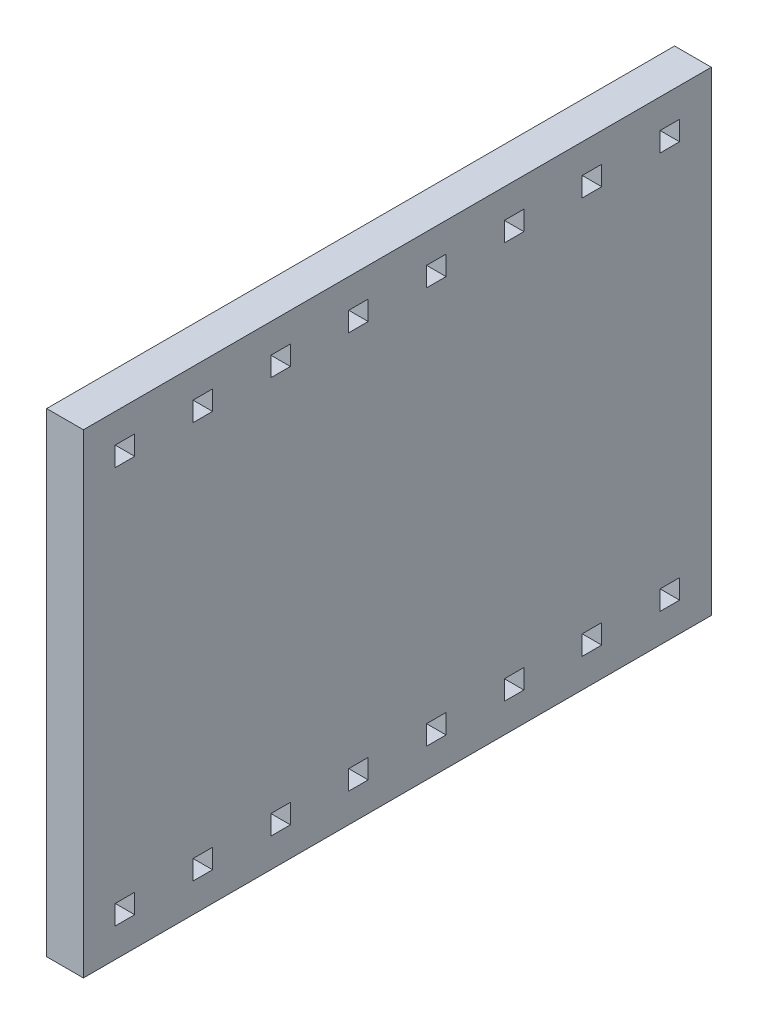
ISO-10303-21;
HEADER;
FILE_DESCRIPTION(('STEP AP214'),'2;1');
FILE_NAME('part.step','',(''),(''),'','','');
FILE_SCHEMA(('AUTOMOTIVE_DESIGN { 1 0 10303 214 1 1 1 1 }'));
ENDSEC;
DATA;
#1=APPLICATION_CONTEXT('core data for automotive mechanical design processes');
#2=APPLICATION_PROTOCOL_DEFINITION('international standard','automotive_design',2000,#1);
#3=PRODUCT_CONTEXT('',#1,'mechanical');
#4=PRODUCT('Part','Part','',(#3));
#5=PRODUCT_RELATED_PRODUCT_CATEGORY('part','',(#4));
#6=PRODUCT_DEFINITION_FORMATION('','',#4);
#7=PRODUCT_DEFINITION_CONTEXT('part definition',#1,'design');
#8=PRODUCT_DEFINITION('design','',#6,#7);
#9=PRODUCT_DEFINITION_SHAPE('','',#8);
#10=(LENGTH_UNIT() NAMED_UNIT(*) SI_UNIT(.MILLI.,.METRE.));
#11=(NAMED_UNIT(*) PLANE_ANGLE_UNIT() SI_UNIT($,.RADIAN.));
#12=(NAMED_UNIT(*) SI_UNIT($,.STERADIAN.) SOLID_ANGLE_UNIT());
#13=UNCERTAINTY_MEASURE_WITH_UNIT(LENGTH_MEASURE(1.E-05),#10,'distance_accuracy_value','');
#14=(GEOMETRIC_REPRESENTATION_CONTEXT(3) GLOBAL_UNCERTAINTY_ASSIGNED_CONTEXT((#13)) GLOBAL_UNIT_ASSIGNED_CONTEXT((#10,
#11,#12)) REPRESENTATION_CONTEXT('',''));
#15=CARTESIAN_POINT('',(0.,0.,0.));
#16=DIRECTION('',(0.,0.,1.));
#17=DIRECTION('',(1.,0.,0.));
#18=AXIS2_PLACEMENT_3D('',#15,#16,#17);
#19=CARTESIAN_POINT('',(1.2,0.,0.));
#20=DIRECTION('',(0.,0.,-1.));
#21=DIRECTION('',(0.,1.,0.));
#22=AXIS2_PLACEMENT_3D('',#19,#20,#21);
#23=PLANE('',#22);
#24=DIRECTION('',(0.,-1.,0.));
#25=VECTOR('',#24,1.);
#26=CARTESIAN_POINT('',(0.,0.,0.));
#27=LINE('',#26,#25);
#28=CARTESIAN_POINT('',(0.,0.,0.));
#29=VERTEX_POINT('',#28);
#30=CARTESIAN_POINT('',(0.,-15.5,0.));
#31=VERTEX_POINT('',#30);
#32=EDGE_CURVE('E969',#29,#31,#27,.T.);
#33=ORIENTED_EDGE('',*,*,#32,.T.);
#34=DIRECTION('',(-1.,0.,0.));
#35=VECTOR('',#34,1.);
#36=CARTESIAN_POINT('',(1.2,-15.5,0.));
#37=LINE('',#36,#35);
#38=CARTESIAN_POINT('',(1.2,-15.5,0.));
#39=VERTEX_POINT('',#38);
#40=EDGE_CURVE('E11',#39,#31,#37,.T.);
#41=ORIENTED_EDGE('',*,*,#40,.F.);
#42=DIRECTION('',(0.,-1.,0.));
#43=VECTOR('',#42,1.);
#44=CARTESIAN_POINT('',(1.2,0.,0.));
#45=LINE('',#44,#43);
#46=CARTESIAN_POINT('',(1.2,0.,0.));
#47=VERTEX_POINT('',#46);
#48=EDGE_CURVE('E976',#47,#39,#45,.T.);
#49=ORIENTED_EDGE('',*,*,#48,.F.);
#50=DIRECTION('',(-1.,0.,0.));
#51=VECTOR('',#50,1.);
#52=CARTESIAN_POINT('',(1.2,0.,0.));
#53=LINE('',#52,#51);
#54=EDGE_CURVE('E986',#47,#29,#53,.T.);
#55=ORIENTED_EDGE('',*,*,#54,.T.);
#56=EDGE_LOOP('',(#33,#41,#49,#55));
#57=FACE_BOUND('',#56,.T.);
#58=ADVANCED_FACE('F35',(#57),#23,.F.);
#59=CARTESIAN_POINT('',(1.2,-15.5,0.));
#60=DIRECTION('',(0.,1.,0.));
#61=DIRECTION('',(0.,0.,1.));
#62=AXIS2_PLACEMENT_3D('',#59,#60,#61);
#63=PLANE('',#62);
#64=DIRECTION('',(0.,0.,-1.));
#65=VECTOR('',#64,1.);
#66=CARTESIAN_POINT('',(0.,-15.5,0.));
#67=LINE('',#66,#65);
#68=CARTESIAN_POINT('',(0.,-15.5,-20.5));
#69=VERTEX_POINT('',#68);
#70=EDGE_CURVE('E989',#31,#69,#67,.T.);
#71=ORIENTED_EDGE('',*,*,#70,.T.);
#72=DIRECTION('',(-1.,0.,0.));
#73=VECTOR('',#72,1.);
#74=CARTESIAN_POINT('',(1.2,-15.5,-20.5));
#75=LINE('',#74,#73);
#76=CARTESIAN_POINT('',(1.2,-15.5,-20.5));
#77=VERTEX_POINT('',#76);
#78=EDGE_CURVE('E42',#77,#69,#75,.T.);
#79=ORIENTED_EDGE('',*,*,#78,.F.);
#80=DIRECTION('',(0.,0.,-1.));
#81=VECTOR('',#80,1.);
#82=CARTESIAN_POINT('',(1.2,-15.5,0.));
#83=LINE('',#82,#81);
#84=EDGE_CURVE('E979',#39,#77,#83,.T.);
#85=ORIENTED_EDGE('',*,*,#84,.F.);
#86=ORIENTED_EDGE('',*,*,#40,.T.);
#87=EDGE_LOOP('',(#71,#79,#85,#86));
#88=FACE_BOUND('',#87,.T.);
#89=ADVANCED_FACE('F1018',(#88),#63,.F.);
#90=CARTESIAN_POINT('',(1.2,0.,-20.5));
#91=DIRECTION('',(0.,0.,1.));
#92=DIRECTION('',(0.,-1.,0.));
#93=AXIS2_PLACEMENT_3D('',#90,#91,#92);
#94=PLANE('',#93);
#95=DIRECTION('',(0.,1.,0.));
#96=VECTOR('',#95,1.);
#97=CARTESIAN_POINT('',(0.,0.,-20.5));
#98=LINE('',#97,#96);
#99=CARTESIAN_POINT('',(0.,0.,-20.5));
#100=VERTEX_POINT('',#99);
#101=EDGE_CURVE('E991',#69,#100,#98,.T.);
#102=ORIENTED_EDGE('',*,*,#101,.T.);
#103=DIRECTION('',(-1.,0.,0.));
#104=VECTOR('',#103,1.);
#105=CARTESIAN_POINT('',(1.2,0.,-20.5));
#106=LINE('',#105,#104);
#107=CARTESIAN_POINT('',(1.2,0.,-20.5));
#108=VERTEX_POINT('',#107);
#109=EDGE_CURVE('E996',#108,#100,#106,.T.);
#110=ORIENTED_EDGE('',*,*,#109,.F.);
#111=DIRECTION('',(0.,1.,0.));
#112=VECTOR('',#111,1.);
#113=CARTESIAN_POINT('',(1.2,0.,-20.5));
#114=LINE('',#113,#112);
#115=EDGE_CURVE('E982',#77,#108,#114,.T.);
#116=ORIENTED_EDGE('',*,*,#115,.F.);
#117=ORIENTED_EDGE('',*,*,#78,.T.);
#118=EDGE_LOOP('',(#102,#110,#116,#117));
#119=FACE_BOUND('',#118,.T.);
#120=ADVANCED_FACE('F1003',(#119),#94,.F.);
#121=CARTESIAN_POINT('',(1.2,0.,0.));
#122=DIRECTION('',(0.,-1.,0.));
#123=DIRECTION('',(0.,0.,-1.));
#124=AXIS2_PLACEMENT_3D('',#121,#122,#123);
#125=PLANE('',#124);
#126=DIRECTION('',(0.,0.,1.));
#127=VECTOR('',#126,1.);
#128=CARTESIAN_POINT('',(0.,0.,0.));
#129=LINE('',#128,#127);
#130=EDGE_CURVE('E980',#100,#29,#129,.T.);
#131=ORIENTED_EDGE('',*,*,#130,.T.);
#132=ORIENTED_EDGE('',*,*,#54,.F.);
#133=DIRECTION('',(0.,0.,1.));
#134=VECTOR('',#133,1.);
#135=CARTESIAN_POINT('',(1.2,0.,0.));
#136=LINE('',#135,#134);
#137=EDGE_CURVE('E984',#108,#47,#136,.T.);
#138=ORIENTED_EDGE('',*,*,#137,.F.);
#139=ORIENTED_EDGE('',*,*,#109,.T.);
#140=EDGE_LOOP('',(#131,#132,#138,#139));
#141=FACE_BOUND('',#140,.T.);
#142=ADVANCED_FACE('F1011',(#141),#125,.F.);
#143=CARTESIAN_POINT('',(1.2,0.,0.));
#144=DIRECTION('',(1.,0.,0.));
#145=DIRECTION('',(0.,0.,-1.));
#146=AXIS2_PLACEMENT_3D('',#143,#144,#145);
#147=PLANE('',#146);
#148=DIRECTION('',(0.,1.,0.));
#149=VECTOR('',#148,1.);
#150=CARTESIAN_POINT('',(1.2,-1.5885,-1.6745));
#151=LINE('',#150,#149);
#152=CARTESIAN_POINT('',(1.2,-1.5885,-1.6745));
#153=VERTEX_POINT('',#152);
#154=CARTESIAN_POINT('',(1.2,-0.952499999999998,-1.6745));
#155=VERTEX_POINT('',#154);
#156=EDGE_CURVE('E49',#153,#155,#151,.T.);
#157=ORIENTED_EDGE('',*,*,#156,.F.);
#158=DIRECTION('',(0.,0.,-1.));
#159=VECTOR('',#158,1.);
#160=CARTESIAN_POINT('',(1.2,-1.5885,-1.6745));
#161=LINE('',#160,#159);
#162=CARTESIAN_POINT('',(1.2,-1.5885,-1.0385));
#163=VERTEX_POINT('',#162);
#164=EDGE_CURVE('E477',#163,#153,#161,.T.);
#165=ORIENTED_EDGE('',*,*,#164,.F.);
#166=DIRECTION('',(0.,-1.,0.));
#167=VECTOR('',#166,1.);
#168=CARTESIAN_POINT('',(1.2,-1.5885,-1.0385));
#169=LINE('',#168,#167);
#170=CARTESIAN_POINT('',(1.2,-0.952499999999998,-1.0385));
#171=VERTEX_POINT('',#170);
#172=EDGE_CURVE('E480',#171,#163,#169,.T.);
#173=ORIENTED_EDGE('',*,*,#172,.F.);
#174=DIRECTION('',(0.,0.,1.));
#175=VECTOR('',#174,1.);
#176=CARTESIAN_POINT('',(1.2,-0.952499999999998,-1.6745));
#177=LINE('',#176,#175);
#178=EDGE_CURVE('E486',#155,#171,#177,.T.);
#179=ORIENTED_EDGE('',*,*,#178,.F.);
#180=EDGE_LOOP('',(#157,#165,#173,#179));
#181=FACE_BOUND('',#180,.T.);
#182=DIRECTION('',(0.,0.,-1.));
#183=VECTOR('',#182,1.);
#184=CARTESIAN_POINT('',(1.2,-1.5885,-4.2155));
#185=LINE('',#184,#183);
#186=CARTESIAN_POINT('',(1.2,-1.5885,-3.5795));
#187=VERTEX_POINT('',#186);
#188=CARTESIAN_POINT('',(1.2,-1.5885,-4.2155));
#189=VERTEX_POINT('',#188);
#190=EDGE_CURVE('E492',#187,#189,#185,.T.);
#191=ORIENTED_EDGE('',*,*,#190,.F.);
#192=DIRECTION('',(0.,-1.,0.));
#193=VECTOR('',#192,1.);
#194=CARTESIAN_POINT('',(1.2,-1.5885,-3.5795));
#195=LINE('',#194,#193);
#196=CARTESIAN_POINT('',(1.2,-0.952499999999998,-3.5795));
#197=VERTEX_POINT('',#196);
#198=EDGE_CURVE('E500',#197,#187,#195,.T.);
#199=ORIENTED_EDGE('',*,*,#198,.F.);
#200=DIRECTION('',(0.,0.,1.));
#201=VECTOR('',#200,1.);
#202=CARTESIAN_POINT('',(1.2,-0.952499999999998,-4.2155));
#203=LINE('',#202,#201);
#204=CARTESIAN_POINT('',(1.2,-0.952499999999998,-4.2155));
#205=VERTEX_POINT('',#204);
#206=EDGE_CURVE('E514',#205,#197,#203,.T.);
#207=ORIENTED_EDGE('',*,*,#206,.F.);
#208=DIRECTION('',(0.,1.,0.));
#209=VECTOR('',#208,1.);
#210=CARTESIAN_POINT('',(1.2,-1.5885,-4.2155));
#211=LINE('',#210,#209);
#212=EDGE_CURVE('E511',#189,#205,#211,.T.);
#213=ORIENTED_EDGE('',*,*,#212,.F.);
#214=EDGE_LOOP('',(#191,#199,#207,#213));
#215=FACE_BOUND('',#214,.T.);
#216=DIRECTION('',(0.,0.,-1.));
#217=VECTOR('',#216,1.);
#218=CARTESIAN_POINT('',(1.2,-1.5885,-6.7565));
#219=LINE('',#218,#217);
#220=CARTESIAN_POINT('',(1.2,-1.5885,-6.1205));
#221=VERTEX_POINT('',#220);
#222=CARTESIAN_POINT('',(1.2,-1.5885,-6.7565));
#223=VERTEX_POINT('',#222);
#224=EDGE_CURVE('E521',#221,#223,#219,.T.);
#225=ORIENTED_EDGE('',*,*,#224,.F.);
#226=DIRECTION('',(0.,-1.,0.));
#227=VECTOR('',#226,1.);
#228=CARTESIAN_POINT('',(1.2,-1.5885,-6.1205));
#229=LINE('',#228,#227);
#230=CARTESIAN_POINT('',(1.2,-0.952499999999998,-6.1205));
#231=VERTEX_POINT('',#230);
#232=EDGE_CURVE('E532',#231,#221,#229,.T.);
#233=ORIENTED_EDGE('',*,*,#232,.F.);
#234=DIRECTION('',(0.,0.,1.));
#235=VECTOR('',#234,1.);
#236=CARTESIAN_POINT('',(1.2,-0.952499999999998,-6.7565));
#237=LINE('',#236,#235);
#238=CARTESIAN_POINT('',(1.2,-0.952499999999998,-6.7565));
#239=VERTEX_POINT('',#238);
#240=EDGE_CURVE('E546',#239,#231,#237,.T.);
#241=ORIENTED_EDGE('',*,*,#240,.F.);
#242=DIRECTION('',(0.,1.,0.));
#243=VECTOR('',#242,1.);
#244=CARTESIAN_POINT('',(1.2,-1.5885,-6.7565));
#245=LINE('',#244,#243);
#246=EDGE_CURVE('E543',#223,#239,#245,.T.);
#247=ORIENTED_EDGE('',*,*,#246,.F.);
#248=EDGE_LOOP('',(#225,#233,#241,#247));
#249=FACE_BOUND('',#248,.T.);
#250=DIRECTION('',(0.,1.,0.));
#251=VECTOR('',#250,1.);
#252=CARTESIAN_POINT('',(1.2,-1.5885,-9.29749999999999));
#253=LINE('',#252,#251);
#254=CARTESIAN_POINT('',(1.2,-1.5885,-9.29749999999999));
#255=VERTEX_POINT('',#254);
#256=CARTESIAN_POINT('',(1.2,-0.9525,-9.29749999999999));
#257=VERTEX_POINT('',#256);
#258=EDGE_CURVE('E553',#255,#257,#253,.T.);
#259=ORIENTED_EDGE('',*,*,#258,.F.);
#260=DIRECTION('',(0.,0.,-1.));
#261=VECTOR('',#260,1.);
#262=CARTESIAN_POINT('',(1.2,-1.5885,-9.29749999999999));
#263=LINE('',#262,#261);
#264=CARTESIAN_POINT('',(1.2,-1.5885,-8.66149999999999));
#265=VERTEX_POINT('',#264);
#266=EDGE_CURVE('E564',#265,#255,#263,.T.);
#267=ORIENTED_EDGE('',*,*,#266,.F.);
#268=DIRECTION('',(0.,-1.,0.));
#269=VECTOR('',#268,1.);
#270=CARTESIAN_POINT('',(1.2,-1.5885,-8.66149999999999));
#271=LINE('',#270,#269);
#272=CARTESIAN_POINT('',(1.2,-0.9525,-8.66149999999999));
#273=VERTEX_POINT('',#272);
#274=EDGE_CURVE('E578',#273,#265,#271,.T.);
#275=ORIENTED_EDGE('',*,*,#274,.F.);
#276=DIRECTION('',(0.,0.,1.));
#277=VECTOR('',#276,1.);
#278=CARTESIAN_POINT('',(1.2,-0.9525,-9.29749999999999));
#279=LINE('',#278,#277);
#280=EDGE_CURVE('E575',#257,#273,#279,.T.);
#281=ORIENTED_EDGE('',*,*,#280,.F.);
#282=EDGE_LOOP('',(#259,#267,#275,#281));
#283=FACE_BOUND('',#282,.T.);
#284=DIRECTION('',(0.,0.,1.));
#285=VECTOR('',#284,1.);
#286=CARTESIAN_POINT('',(1.2,-0.9525,-11.2025));
#287=LINE('',#286,#285);
#288=CARTESIAN_POINT('',(1.2,-0.9525,-11.8385));
#289=VERTEX_POINT('',#288);
#290=CARTESIAN_POINT('',(1.2,-0.9525,-11.2025));
#291=VERTEX_POINT('',#290);
#292=EDGE_CURVE('E585',#289,#291,#287,.T.);
#293=ORIENTED_EDGE('',*,*,#292,.F.);
#294=DIRECTION('',(0.,1.,0.));
#295=VECTOR('',#294,1.);
#296=CARTESIAN_POINT('',(1.2,-1.5885,-11.8385));
#297=LINE('',#296,#295);
#298=CARTESIAN_POINT('',(1.2,-1.5885,-11.8385));
#299=VERTEX_POINT('',#298);
#300=EDGE_CURVE('E596',#299,#289,#297,.T.);
#301=ORIENTED_EDGE('',*,*,#300,.F.);
#302=DIRECTION('',(0.,0.,-1.));
#303=VECTOR('',#302,1.);
#304=CARTESIAN_POINT('',(1.2,-1.5885,-11.2025));
#305=LINE('',#304,#303);
#306=CARTESIAN_POINT('',(1.2,-1.5885,-11.2025));
#307=VERTEX_POINT('',#306);
#308=EDGE_CURVE('E610',#307,#299,#305,.T.);
#309=ORIENTED_EDGE('',*,*,#308,.F.);
#310=DIRECTION('',(0.,-1.,0.));
#311=VECTOR('',#310,1.);
#312=CARTESIAN_POINT('',(1.2,-1.5885,-11.2025));
#313=LINE('',#312,#311);
#314=EDGE_CURVE('E607',#291,#307,#313,.T.);
#315=ORIENTED_EDGE('',*,*,#314,.F.);
#316=EDGE_LOOP('',(#293,#301,#309,#315));
#317=FACE_BOUND('',#316,.T.);
#318=DIRECTION('',(0.,0.,1.));
#319=VECTOR('',#318,1.);
#320=CARTESIAN_POINT('',(1.2,-0.9525,-13.7435));
#321=LINE('',#320,#319);
#322=CARTESIAN_POINT('',(1.2,-0.9525,-14.3795));
#323=VERTEX_POINT('',#322);
#324=CARTESIAN_POINT('',(1.2,-0.9525,-13.7435));
#325=VERTEX_POINT('',#324);
#326=EDGE_CURVE('E617',#323,#325,#321,.T.);
#327=ORIENTED_EDGE('',*,*,#326,.F.);
#328=DIRECTION('',(0.,1.,0.));
#329=VECTOR('',#328,1.);
#330=CARTESIAN_POINT('',(1.2,-1.5885,-14.3795));
#331=LINE('',#330,#329);
#332=CARTESIAN_POINT('',(1.2,-1.5885,-14.3795));
#333=VERTEX_POINT('',#332);
#334=EDGE_CURVE('E628',#333,#323,#331,.T.);
#335=ORIENTED_EDGE('',*,*,#334,.F.);
#336=DIRECTION('',(0.,0.,-1.));
#337=VECTOR('',#336,1.);
#338=CARTESIAN_POINT('',(1.2,-1.5885,-13.7435));
#339=LINE('',#338,#337);
#340=CARTESIAN_POINT('',(1.2,-1.5885,-13.7435));
#341=VERTEX_POINT('',#340);
#342=EDGE_CURVE('E642',#341,#333,#339,.T.);
#343=ORIENTED_EDGE('',*,*,#342,.F.);
#344=DIRECTION('',(0.,-1.,0.));
#345=VECTOR('',#344,1.);
#346=CARTESIAN_POINT('',(1.2,-1.5885,-13.7435));
#347=LINE('',#346,#345);
#348=EDGE_CURVE('E639',#325,#341,#347,.T.);
#349=ORIENTED_EDGE('',*,*,#348,.F.);
#350=EDGE_LOOP('',(#327,#335,#343,#349));
#351=FACE_BOUND('',#350,.T.);
#352=DIRECTION('',(0.,-1.,0.));
#353=VECTOR('',#352,1.);
#354=CARTESIAN_POINT('',(1.2,-1.5885,-18.8255));
#355=LINE('',#354,#353);
#356=CARTESIAN_POINT('',(1.2,-0.9525,-18.8255));
#357=VERTEX_POINT('',#356);
#358=CARTESIAN_POINT('',(1.2,-1.5885,-18.8255));
#359=VERTEX_POINT('',#358);
#360=EDGE_CURVE('E649',#357,#359,#355,.T.);
#361=ORIENTED_EDGE('',*,*,#360,.F.);
#362=DIRECTION('',(0.,0.,1.));
#363=VECTOR('',#362,1.);
#364=CARTESIAN_POINT('',(1.2,-0.9525,-18.8255));
#365=LINE('',#364,#363);
#366=CARTESIAN_POINT('',(1.2,-0.9525,-19.4615));
#367=VERTEX_POINT('',#366);
#368=EDGE_CURVE('E660',#367,#357,#365,.T.);
#369=ORIENTED_EDGE('',*,*,#368,.F.);
#370=DIRECTION('',(0.,1.,0.));
#371=VECTOR('',#370,1.);
#372=CARTESIAN_POINT('',(1.2,-1.5885,-19.4615));
#373=LINE('',#372,#371);
#374=CARTESIAN_POINT('',(1.2,-1.5885,-19.4615));
#375=VERTEX_POINT('',#374);
#376=EDGE_CURVE('E674',#375,#367,#373,.T.);
#377=ORIENTED_EDGE('',*,*,#376,.F.);
#378=DIRECTION('',(0.,0.,-1.));
#379=VECTOR('',#378,1.);
#380=CARTESIAN_POINT('',(1.2,-1.5885,-18.8255));
#381=LINE('',#380,#379);
#382=EDGE_CURVE('E671',#359,#375,#381,.T.);
#383=ORIENTED_EDGE('',*,*,#382,.F.);
#384=EDGE_LOOP('',(#361,#369,#377,#383));
#385=FACE_BOUND('',#384,.T.);
#386=DIRECTION('',(0.,0.,1.));
#387=VECTOR('',#386,1.);
#388=CARTESIAN_POINT('',(1.2,-0.9525,-16.2845));
#389=LINE('',#388,#387);
#390=CARTESIAN_POINT('',(1.2,-0.9525,-16.9205));
#391=VERTEX_POINT('',#390);
#392=CARTESIAN_POINT('',(1.2,-0.9525,-16.2845));
#393=VERTEX_POINT('',#392);
#394=EDGE_CURVE('E681',#391,#393,#389,.T.);
#395=ORIENTED_EDGE('',*,*,#394,.F.);
#396=DIRECTION('',(0.,1.,0.));
#397=VECTOR('',#396,1.);
#398=CARTESIAN_POINT('',(1.2,-1.5885,-16.9205));
#399=LINE('',#398,#397);
#400=CARTESIAN_POINT('',(1.2,-1.5885,-16.9205));
#401=VERTEX_POINT('',#400);
#402=EDGE_CURVE('E692',#401,#391,#399,.T.);
#403=ORIENTED_EDGE('',*,*,#402,.F.);
#404=DIRECTION('',(0.,0.,-1.));
#405=VECTOR('',#404,1.);
#406=CARTESIAN_POINT('',(1.2,-1.5885,-16.2845));
#407=LINE('',#406,#405);
#408=CARTESIAN_POINT('',(1.2,-1.5885,-16.2845));
#409=VERTEX_POINT('',#408);
#410=EDGE_CURVE('E706',#409,#401,#407,.T.);
#411=ORIENTED_EDGE('',*,*,#410,.F.);
#412=DIRECTION('',(0.,-1.,0.));
#413=VECTOR('',#412,1.);
#414=CARTESIAN_POINT('',(1.2,-1.5885,-16.2845));
#415=LINE('',#414,#413);
#416=EDGE_CURVE('E703',#393,#409,#415,.T.);
#417=ORIENTED_EDGE('',*,*,#416,.F.);
#418=EDGE_LOOP('',(#395,#403,#411,#417));
#419=FACE_BOUND('',#418,.T.);
#420=DIRECTION('',(0.,0.,1.));
#421=VECTOR('',#420,1.);
#422=CARTESIAN_POINT('',(1.2,-13.9115,-9.2975));
#423=LINE('',#422,#421);
#424=CARTESIAN_POINT('',(1.2,-13.9115,-9.2975));
#425=VERTEX_POINT('',#424);
#426=CARTESIAN_POINT('',(1.2,-13.9115,-8.6615));
#427=VERTEX_POINT('',#426);
#428=EDGE_CURVE('E713',#425,#427,#423,.T.);
#429=ORIENTED_EDGE('',*,*,#428,.F.);
#430=DIRECTION('',(0.,1.,0.));
#431=VECTOR('',#430,1.);
#432=CARTESIAN_POINT('',(1.2,-13.9115,-9.2975));
#433=LINE('',#432,#431);
#434=CARTESIAN_POINT('',(1.2,-14.5475,-9.2975));
#435=VERTEX_POINT('',#434);
#436=EDGE_CURVE('E724',#435,#425,#433,.T.);
#437=ORIENTED_EDGE('',*,*,#436,.F.);
#438=DIRECTION('',(0.,0.,-1.));
#439=VECTOR('',#438,1.);
#440=CARTESIAN_POINT('',(1.2,-14.5475,-9.2975));
#441=LINE('',#440,#439);
#442=CARTESIAN_POINT('',(1.2,-14.5475,-8.6615));
#443=VERTEX_POINT('',#442);
#444=EDGE_CURVE('E738',#443,#435,#441,.T.);
#445=ORIENTED_EDGE('',*,*,#444,.F.);
#446=DIRECTION('',(0.,-1.,0.));
#447=VECTOR('',#446,1.);
#448=CARTESIAN_POINT('',(1.2,-13.9115,-8.6615));
#449=LINE('',#448,#447);
#450=EDGE_CURVE('E735',#427,#443,#449,.T.);
#451=ORIENTED_EDGE('',*,*,#450,.F.);
#452=EDGE_LOOP('',(#429,#437,#445,#451));
#453=FACE_BOUND('',#452,.T.);
#454=DIRECTION('',(0.,0.,1.));
#455=VECTOR('',#454,1.);
#456=CARTESIAN_POINT('',(1.2,-13.9115,-11.2025));
#457=LINE('',#456,#455);
#458=CARTESIAN_POINT('',(1.2,-13.9115,-11.8385));
#459=VERTEX_POINT('',#458);
#460=CARTESIAN_POINT('',(1.2,-13.9115,-11.2025));
#461=VERTEX_POINT('',#460);
#462=EDGE_CURVE('E745',#459,#461,#457,.T.);
#463=ORIENTED_EDGE('',*,*,#462,.F.);
#464=DIRECTION('',(0.,1.,0.));
#465=VECTOR('',#464,1.);
#466=CARTESIAN_POINT('',(1.2,-13.9115,-11.8385));
#467=LINE('',#466,#465);
#468=CARTESIAN_POINT('',(1.2,-14.5475,-11.8385));
#469=VERTEX_POINT('',#468);
#470=EDGE_CURVE('E756',#469,#459,#467,.T.);
#471=ORIENTED_EDGE('',*,*,#470,.F.);
#472=DIRECTION('',(0.,0.,-1.));
#473=VECTOR('',#472,1.);
#474=CARTESIAN_POINT('',(1.2,-14.5475,-11.2025));
#475=LINE('',#474,#473);
#476=CARTESIAN_POINT('',(1.2,-14.5475,-11.2025));
#477=VERTEX_POINT('',#476);
#478=EDGE_CURVE('E770',#477,#469,#475,.T.);
#479=ORIENTED_EDGE('',*,*,#478,.F.);
#480=DIRECTION('',(0.,-1.,0.));
#481=VECTOR('',#480,1.);
#482=CARTESIAN_POINT('',(1.2,-13.9115,-11.2025));
#483=LINE('',#482,#481);
#484=EDGE_CURVE('E767',#461,#477,#483,.T.);
#485=ORIENTED_EDGE('',*,*,#484,.F.);
#486=EDGE_LOOP('',(#463,#471,#479,#485));
#487=FACE_BOUND('',#486,.T.);
#488=DIRECTION('',(0.,1.,0.));
#489=VECTOR('',#488,1.);
#490=CARTESIAN_POINT('',(1.2,-13.9115,-6.7565));
#491=LINE('',#490,#489);
#492=CARTESIAN_POINT('',(1.2,-14.5475,-6.7565));
#493=VERTEX_POINT('',#492);
#494=CARTESIAN_POINT('',(1.2,-13.9115,-6.7565));
#495=VERTEX_POINT('',#494);
#496=EDGE_CURVE('E777',#493,#495,#491,.T.);
#497=ORIENTED_EDGE('',*,*,#496,.F.);
#498=DIRECTION('',(0.,0.,-1.));
#499=VECTOR('',#498,1.);
#500=CARTESIAN_POINT('',(1.2,-14.5475,-6.7565));
#501=LINE('',#500,#499);
#502=CARTESIAN_POINT('',(1.2,-14.5475,-6.1205));
#503=VERTEX_POINT('',#502);
#504=EDGE_CURVE('E788',#503,#493,#501,.T.);
#505=ORIENTED_EDGE('',*,*,#504,.F.);
#506=DIRECTION('',(0.,-1.,0.));
#507=VECTOR('',#506,1.);
#508=CARTESIAN_POINT('',(1.2,-13.9115,-6.1205));
#509=LINE('',#508,#507);
#510=CARTESIAN_POINT('',(1.2,-13.9115,-6.1205));
#511=VERTEX_POINT('',#510);
#512=EDGE_CURVE('E802',#511,#503,#509,.T.);
#513=ORIENTED_EDGE('',*,*,#512,.F.);
#514=DIRECTION('',(0.,0.,1.));
#515=VECTOR('',#514,1.);
#516=CARTESIAN_POINT('',(1.2,-13.9115,-6.7565));
#517=LINE('',#516,#515);
#518=EDGE_CURVE('E799',#495,#511,#517,.T.);
#519=ORIENTED_EDGE('',*,*,#518,.F.);
#520=EDGE_LOOP('',(#497,#505,#513,#519));
#521=FACE_BOUND('',#520,.T.);
#522=DIRECTION('',(0.,1.,0.));
#523=VECTOR('',#522,1.);
#524=CARTESIAN_POINT('',(1.2,-13.9115,-4.2155));
#525=LINE('',#524,#523);
#526=CARTESIAN_POINT('',(1.2,-14.5475,-4.2155));
#527=VERTEX_POINT('',#526);
#528=CARTESIAN_POINT('',(1.2,-13.9115,-4.2155));
#529=VERTEX_POINT('',#528);
#530=EDGE_CURVE('E809',#527,#529,#525,.T.);
#531=ORIENTED_EDGE('',*,*,#530,.F.);
#532=DIRECTION('',(0.,0.,-1.));
#533=VECTOR('',#532,1.);
#534=CARTESIAN_POINT('',(1.2,-14.5475,-4.2155));
#535=LINE('',#534,#533);
#536=CARTESIAN_POINT('',(1.2,-14.5475,-3.5795));
#537=VERTEX_POINT('',#536);
#538=EDGE_CURVE('E820',#537,#527,#535,.T.);
#539=ORIENTED_EDGE('',*,*,#538,.F.);
#540=DIRECTION('',(0.,-1.,0.));
#541=VECTOR('',#540,1.);
#542=CARTESIAN_POINT('',(1.2,-13.9115,-3.5795));
#543=LINE('',#542,#541);
#544=CARTESIAN_POINT('',(1.2,-13.9115,-3.5795));
#545=VERTEX_POINT('',#544);
#546=EDGE_CURVE('E834',#545,#537,#543,.T.);
#547=ORIENTED_EDGE('',*,*,#546,.F.);
#548=DIRECTION('',(0.,0.,1.));
#549=VECTOR('',#548,1.);
#550=CARTESIAN_POINT('',(1.2,-13.9115,-4.2155));
#551=LINE('',#550,#549);
#552=EDGE_CURVE('E831',#529,#545,#551,.T.);
#553=ORIENTED_EDGE('',*,*,#552,.F.);
#554=EDGE_LOOP('',(#531,#539,#547,#553));
#555=FACE_BOUND('',#554,.T.);
#556=DIRECTION('',(0.,1.,0.));
#557=VECTOR('',#556,1.);
#558=CARTESIAN_POINT('',(1.2,-13.9115,-1.6745));
#559=LINE('',#558,#557);
#560=CARTESIAN_POINT('',(1.2,-14.5475,-1.6745));
#561=VERTEX_POINT('',#560);
#562=CARTESIAN_POINT('',(1.2,-13.9115,-1.6745));
#563=VERTEX_POINT('',#562);
#564=EDGE_CURVE('E841',#561,#563,#559,.T.);
#565=ORIENTED_EDGE('',*,*,#564,.F.);
#566=DIRECTION('',(0.,0.,-1.));
#567=VECTOR('',#566,1.);
#568=CARTESIAN_POINT('',(1.2,-14.5475,-1.6745));
#569=LINE('',#568,#567);
#570=CARTESIAN_POINT('',(1.2,-14.5475,-1.0385));
#571=VERTEX_POINT('',#570);
#572=EDGE_CURVE('E852',#571,#561,#569,.T.);
#573=ORIENTED_EDGE('',*,*,#572,.F.);
#574=DIRECTION('',(0.,-1.,0.));
#575=VECTOR('',#574,1.);
#576=CARTESIAN_POINT('',(1.2,-13.9115,-1.0385));
#577=LINE('',#576,#575);
#578=CARTESIAN_POINT('',(1.2,-13.9115,-1.0385));
#579=VERTEX_POINT('',#578);
#580=EDGE_CURVE('E866',#579,#571,#577,.T.);
#581=ORIENTED_EDGE('',*,*,#580,.F.);
#582=DIRECTION('',(0.,0.,1.));
#583=VECTOR('',#582,1.);
#584=CARTESIAN_POINT('',(1.2,-13.9115,-1.6745));
#585=LINE('',#584,#583);
#586=EDGE_CURVE('E863',#563,#579,#585,.T.);
#587=ORIENTED_EDGE('',*,*,#586,.F.);
#588=EDGE_LOOP('',(#565,#573,#581,#587));
#589=FACE_BOUND('',#588,.T.);
#590=DIRECTION('',(0.,1.,0.));
#591=VECTOR('',#590,1.);
#592=CARTESIAN_POINT('',(1.2,-13.9115,-19.4615));
#593=LINE('',#592,#591);
#594=CARTESIAN_POINT('',(1.2,-14.5475,-19.4615));
#595=VERTEX_POINT('',#594);
#596=CARTESIAN_POINT('',(1.2,-13.9115,-19.4615));
#597=VERTEX_POINT('',#596);
#598=EDGE_CURVE('E873',#595,#597,#593,.T.);
#599=ORIENTED_EDGE('',*,*,#598,.F.);
#600=DIRECTION('',(0.,0.,-1.));
#601=VECTOR('',#600,1.);
#602=CARTESIAN_POINT('',(1.2,-14.5475,-18.8255));
#603=LINE('',#602,#601);
#604=CARTESIAN_POINT('',(1.2,-14.5475,-18.8255));
#605=VERTEX_POINT('',#604);
#606=EDGE_CURVE('E884',#605,#595,#603,.T.);
#607=ORIENTED_EDGE('',*,*,#606,.F.);
#608=DIRECTION('',(0.,-1.,0.));
#609=VECTOR('',#608,1.);
#610=CARTESIAN_POINT('',(1.2,-13.9115,-18.8255));
#611=LINE('',#610,#609);
#612=CARTESIAN_POINT('',(1.2,-13.9115,-18.8255));
#613=VERTEX_POINT('',#612);
#614=EDGE_CURVE('E898',#613,#605,#611,.T.);
#615=ORIENTED_EDGE('',*,*,#614,.F.);
#616=DIRECTION('',(0.,0.,1.));
#617=VECTOR('',#616,1.);
#618=CARTESIAN_POINT('',(1.2,-13.9115,-18.8255));
#619=LINE('',#618,#617);
#620=EDGE_CURVE('E895',#597,#613,#619,.T.);
#621=ORIENTED_EDGE('',*,*,#620,.F.);
#622=EDGE_LOOP('',(#599,#607,#615,#621));
#623=FACE_BOUND('',#622,.T.);
#624=DIRECTION('',(0.,-1.,0.));
#625=VECTOR('',#624,1.);
#626=CARTESIAN_POINT('',(1.2,-13.9115,-16.2845));
#627=LINE('',#626,#625);
#628=CARTESIAN_POINT('',(1.2,-13.9115,-16.2845));
#629=VERTEX_POINT('',#628);
#630=CARTESIAN_POINT('',(1.2,-14.5475,-16.2845));
#631=VERTEX_POINT('',#630);
#632=EDGE_CURVE('E905',#629,#631,#627,.T.);
#633=ORIENTED_EDGE('',*,*,#632,.F.);
#634=DIRECTION('',(0.,0.,1.));
#635=VECTOR('',#634,1.);
#636=CARTESIAN_POINT('',(1.2,-13.9115,-16.2845));
#637=LINE('',#636,#635);
#638=CARTESIAN_POINT('',(1.2,-13.9115,-16.9205));
#639=VERTEX_POINT('',#638);
#640=EDGE_CURVE('E916',#639,#629,#637,.T.);
#641=ORIENTED_EDGE('',*,*,#640,.F.);
#642=DIRECTION('',(0.,1.,0.));
#643=VECTOR('',#642,1.);
#644=CARTESIAN_POINT('',(1.2,-13.9115,-16.9205));
#645=LINE('',#644,#643);
#646=CARTESIAN_POINT('',(1.2,-14.5475,-16.9205));
#647=VERTEX_POINT('',#646);
#648=EDGE_CURVE('E930',#647,#639,#645,.T.);
#649=ORIENTED_EDGE('',*,*,#648,.F.);
#650=DIRECTION('',(0.,0.,-1.));
#651=VECTOR('',#650,1.);
#652=CARTESIAN_POINT('',(1.2,-14.5475,-16.2845));
#653=LINE('',#652,#651);
#654=EDGE_CURVE('E927',#631,#647,#653,.T.);
#655=ORIENTED_EDGE('',*,*,#654,.F.);
#656=EDGE_LOOP('',(#633,#641,#649,#655));
#657=FACE_BOUND('',#656,.T.);
#658=DIRECTION('',(0.,1.,0.));
#659=VECTOR('',#658,1.);
#660=CARTESIAN_POINT('',(1.2,-13.9115,-14.3795));
#661=LINE('',#660,#659);
#662=CARTESIAN_POINT('',(1.2,-14.5475,-14.3795));
#663=VERTEX_POINT('',#662);
#664=CARTESIAN_POINT('',(1.2,-13.9115,-14.3795));
#665=VERTEX_POINT('',#664);
#666=EDGE_CURVE('E937',#663,#665,#661,.T.);
#667=ORIENTED_EDGE('',*,*,#666,.F.);
#668=DIRECTION('',(0.,0.,-1.));
#669=VECTOR('',#668,1.);
#670=CARTESIAN_POINT('',(1.2,-14.5475,-13.7435));
#671=LINE('',#670,#669);
#672=CARTESIAN_POINT('',(1.2,-14.5475,-13.7435));
#673=VERTEX_POINT('',#672);
#674=EDGE_CURVE('E948',#673,#663,#671,.T.);
#675=ORIENTED_EDGE('',*,*,#674,.F.);
#676=DIRECTION('',(0.,-1.,0.));
#677=VECTOR('',#676,1.);
#678=CARTESIAN_POINT('',(1.2,-13.9115,-13.7435));
#679=LINE('',#678,#677);
#680=CARTESIAN_POINT('',(1.2,-13.9115,-13.7435));
#681=VERTEX_POINT('',#680);
#682=EDGE_CURVE('E962',#681,#673,#679,.T.);
#683=ORIENTED_EDGE('',*,*,#682,.F.);
#684=DIRECTION('',(0.,0.,1.));
#685=VECTOR('',#684,1.);
#686=CARTESIAN_POINT('',(1.2,-13.9115,-13.7435));
#687=LINE('',#686,#685);
#688=EDGE_CURVE('E959',#665,#681,#687,.T.);
#689=ORIENTED_EDGE('',*,*,#688,.F.);
#690=EDGE_LOOP('',(#667,#675,#683,#689));
#691=FACE_BOUND('',#690,.T.);
#692=ORIENTED_EDGE('',*,*,#48,.T.);
#693=ORIENTED_EDGE('',*,*,#84,.T.);
#694=ORIENTED_EDGE('',*,*,#115,.T.);
#695=ORIENTED_EDGE('',*,*,#137,.T.);
#696=EDGE_LOOP('',(#692,#693,#694,#695));
#697=FACE_BOUND('',#696,.T.);
#698=ADVANCED_FACE('F1017',(#181,#215,#249,#283,#317,#351,#385,#419,#453,#487,#521,#555,#589,
#623,#657,#691,#697),#147,.T.);
#699=CARTESIAN_POINT('',(0.,0.,0.));
#700=DIRECTION('',(1.,0.,0.));
#701=DIRECTION('',(0.,0.,-1.));
#702=AXIS2_PLACEMENT_3D('',#699,#700,#701);
#703=PLANE('',#702);
#704=DIRECTION('',(0.,0.,-1.));
#705=VECTOR('',#704,1.);
#706=CARTESIAN_POINT('',(0.,-1.5885,-1.6745));
#707=LINE('',#706,#705);
#708=CARTESIAN_POINT('',(0.,-1.5885,-1.0385));
#709=VERTEX_POINT('',#708);
#710=CARTESIAN_POINT('',(0.,-1.5885,-1.6745));
#711=VERTEX_POINT('',#710);
#712=EDGE_CURVE('E467',#709,#711,#707,.T.);
#713=ORIENTED_EDGE('',*,*,#712,.T.);
#714=DIRECTION('',(0.,1.,0.));
#715=VECTOR('',#714,1.);
#716=CARTESIAN_POINT('',(0.,-1.5885,-1.6745));
#717=LINE('',#716,#715);
#718=CARTESIAN_POINT('',(0.,-0.952499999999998,-1.6745));
#719=VERTEX_POINT('',#718);
#720=EDGE_CURVE('E461',#711,#719,#717,.T.);
#721=ORIENTED_EDGE('',*,*,#720,.T.);
#722=DIRECTION('',(0.,0.,1.));
#723=VECTOR('',#722,1.);
#724=CARTESIAN_POINT('',(0.,-0.952499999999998,-1.6745));
#725=LINE('',#724,#723);
#726=CARTESIAN_POINT('',(0.,-0.952499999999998,-1.0385));
#727=VERTEX_POINT('',#726);
#728=EDGE_CURVE('E470',#719,#727,#725,.T.);
#729=ORIENTED_EDGE('',*,*,#728,.T.);
#730=DIRECTION('',(0.,-1.,0.));
#731=VECTOR('',#730,1.);
#732=CARTESIAN_POINT('',(0.,-1.5885,-1.0385));
#733=LINE('',#732,#731);
#734=EDGE_CURVE('E57',#727,#709,#733,.T.);
#735=ORIENTED_EDGE('',*,*,#734,.T.);
#736=EDGE_LOOP('',(#713,#721,#729,#735));
#737=FACE_BOUND('',#736,.T.);
#738=DIRECTION('',(0.,-1.,0.));
#739=VECTOR('',#738,1.);
#740=CARTESIAN_POINT('',(0.,-1.5885,-3.5795));
#741=LINE('',#740,#739);
#742=CARTESIAN_POINT('',(0.,-0.952499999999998,-3.5795));
#743=VERTEX_POINT('',#742);
#744=CARTESIAN_POINT('',(0.,-1.5885,-3.5795));
#745=VERTEX_POINT('',#744);
#746=EDGE_CURVE('E506',#743,#745,#741,.T.);
#747=ORIENTED_EDGE('',*,*,#746,.T.);
#748=DIRECTION('',(0.,0.,-1.));
#749=VECTOR('',#748,1.);
#750=CARTESIAN_POINT('',(0.,-1.5885,-4.2155));
#751=LINE('',#750,#749);
#752=CARTESIAN_POINT('',(0.,-1.5885,-4.2155));
#753=VERTEX_POINT('',#752);
#754=EDGE_CURVE('E496',#745,#753,#751,.T.);
#755=ORIENTED_EDGE('',*,*,#754,.T.);
#756=DIRECTION('',(0.,1.,0.));
#757=VECTOR('',#756,1.);
#758=CARTESIAN_POINT('',(0.,-1.5885,-4.2155));
#759=LINE('',#758,#757);
#760=CARTESIAN_POINT('',(0.,-0.952499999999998,-4.2155));
#761=VERTEX_POINT('',#760);
#762=EDGE_CURVE('E499',#753,#761,#759,.T.);
#763=ORIENTED_EDGE('',*,*,#762,.T.);
#764=DIRECTION('',(0.,0.,1.));
#765=VECTOR('',#764,1.);
#766=CARTESIAN_POINT('',(0.,-0.952499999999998,-4.2155));
#767=LINE('',#766,#765);
#768=EDGE_CURVE('E503',#761,#743,#767,.T.);
#769=ORIENTED_EDGE('',*,*,#768,.T.);
#770=EDGE_LOOP('',(#747,#755,#763,#769));
#771=FACE_BOUND('',#770,.T.);
#772=DIRECTION('',(0.,-1.,0.));
#773=VECTOR('',#772,1.);
#774=CARTESIAN_POINT('',(0.,-1.5885,-6.1205));
#775=LINE('',#774,#773);
#776=CARTESIAN_POINT('',(0.,-0.952499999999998,-6.1205));
#777=VERTEX_POINT('',#776);
#778=CARTESIAN_POINT('',(0.,-1.5885,-6.1205));
#779=VERTEX_POINT('',#778);
#780=EDGE_CURVE('E538',#777,#779,#775,.T.);
#781=ORIENTED_EDGE('',*,*,#780,.T.);
#782=DIRECTION('',(0.,0.,-1.));
#783=VECTOR('',#782,1.);
#784=CARTESIAN_POINT('',(0.,-1.5885,-6.7565));
#785=LINE('',#784,#783);
#786=CARTESIAN_POINT('',(0.,-1.5885,-6.7565));
#787=VERTEX_POINT('',#786);
#788=EDGE_CURVE('E528',#779,#787,#785,.T.);
#789=ORIENTED_EDGE('',*,*,#788,.T.);
#790=DIRECTION('',(0.,1.,0.));
#791=VECTOR('',#790,1.);
#792=CARTESIAN_POINT('',(0.,-1.5885,-6.7565));
#793=LINE('',#792,#791);
#794=CARTESIAN_POINT('',(0.,-0.952499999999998,-6.7565));
#795=VERTEX_POINT('',#794);
#796=EDGE_CURVE('E531',#787,#795,#793,.T.);
#797=ORIENTED_EDGE('',*,*,#796,.T.);
#798=DIRECTION('',(0.,0.,1.));
#799=VECTOR('',#798,1.);
#800=CARTESIAN_POINT('',(0.,-0.952499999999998,-6.7565));
#801=LINE('',#800,#799);
#802=EDGE_CURVE('E535',#795,#777,#801,.T.);
#803=ORIENTED_EDGE('',*,*,#802,.T.);
#804=EDGE_LOOP('',(#781,#789,#797,#803));
#805=FACE_BOUND('',#804,.T.);
#806=DIRECTION('',(0.,0.,-1.));
#807=VECTOR('',#806,1.);
#808=CARTESIAN_POINT('',(0.,-1.5885,-9.29749999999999));
#809=LINE('',#808,#807);
#810=CARTESIAN_POINT('',(0.,-1.5885,-8.66149999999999));
#811=VERTEX_POINT('',#810);
#812=CARTESIAN_POINT('',(0.,-1.5885,-9.29749999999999));
#813=VERTEX_POINT('',#812);
#814=EDGE_CURVE('E570',#811,#813,#809,.T.);
#815=ORIENTED_EDGE('',*,*,#814,.T.);
#816=DIRECTION('',(0.,1.,0.));
#817=VECTOR('',#816,1.);
#818=CARTESIAN_POINT('',(0.,-1.5885,-9.29749999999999));
#819=LINE('',#818,#817);
#820=CARTESIAN_POINT('',(0.,-0.9525,-9.29749999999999));
#821=VERTEX_POINT('',#820);
#822=EDGE_CURVE('E560',#813,#821,#819,.T.);
#823=ORIENTED_EDGE('',*,*,#822,.T.);
#824=DIRECTION('',(0.,0.,1.));
#825=VECTOR('',#824,1.);
#826=CARTESIAN_POINT('',(0.,-0.9525,-9.29749999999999));
#827=LINE('',#826,#825);
#828=CARTESIAN_POINT('',(0.,-0.9525,-8.66149999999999));
#829=VERTEX_POINT('',#828);
#830=EDGE_CURVE('E563',#821,#829,#827,.T.);
#831=ORIENTED_EDGE('',*,*,#830,.T.);
#832=DIRECTION('',(0.,-1.,0.));
#833=VECTOR('',#832,1.);
#834=CARTESIAN_POINT('',(0.,-1.5885,-8.66149999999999));
#835=LINE('',#834,#833);
#836=EDGE_CURVE('E567',#829,#811,#835,.T.);
#837=ORIENTED_EDGE('',*,*,#836,.T.);
#838=EDGE_LOOP('',(#815,#823,#831,#837));
#839=FACE_BOUND('',#838,.T.);
#840=DIRECTION('',(0.,1.,0.));
#841=VECTOR('',#840,1.);
#842=CARTESIAN_POINT('',(0.,-1.5885,-11.8385));
#843=LINE('',#842,#841);
#844=CARTESIAN_POINT('',(0.,-1.5885,-11.8385));
#845=VERTEX_POINT('',#844);
#846=CARTESIAN_POINT('',(0.,-0.9525,-11.8385));
#847=VERTEX_POINT('',#846);
#848=EDGE_CURVE('E602',#845,#847,#843,.T.);
#849=ORIENTED_EDGE('',*,*,#848,.T.);
#850=DIRECTION('',(0.,0.,1.));
#851=VECTOR('',#850,1.);
#852=CARTESIAN_POINT('',(0.,-0.9525,-11.2025));
#853=LINE('',#852,#851);
#854=CARTESIAN_POINT('',(0.,-0.9525,-11.2025));
#855=VERTEX_POINT('',#854);
#856=EDGE_CURVE('E592',#847,#855,#853,.T.);
#857=ORIENTED_EDGE('',*,*,#856,.T.);
#858=DIRECTION('',(0.,-1.,0.));
#859=VECTOR('',#858,1.);
#860=CARTESIAN_POINT('',(0.,-1.5885,-11.2025));
#861=LINE('',#860,#859);
#862=CARTESIAN_POINT('',(0.,-1.5885,-11.2025));
#863=VERTEX_POINT('',#862);
#864=EDGE_CURVE('E595',#855,#863,#861,.T.);
#865=ORIENTED_EDGE('',*,*,#864,.T.);
#866=DIRECTION('',(0.,0.,-1.));
#867=VECTOR('',#866,1.);
#868=CARTESIAN_POINT('',(0.,-1.5885,-11.2025));
#869=LINE('',#868,#867);
#870=EDGE_CURVE('E599',#863,#845,#869,.T.);
#871=ORIENTED_EDGE('',*,*,#870,.T.);
#872=EDGE_LOOP('',(#849,#857,#865,#871));
#873=FACE_BOUND('',#872,.T.);
#874=DIRECTION('',(0.,1.,0.));
#875=VECTOR('',#874,1.);
#876=CARTESIAN_POINT('',(0.,-1.5885,-14.3795));
#877=LINE('',#876,#875);
#878=CARTESIAN_POINT('',(0.,-1.5885,-14.3795));
#879=VERTEX_POINT('',#878);
#880=CARTESIAN_POINT('',(0.,-0.9525,-14.3795));
#881=VERTEX_POINT('',#880);
#882=EDGE_CURVE('E634',#879,#881,#877,.T.);
#883=ORIENTED_EDGE('',*,*,#882,.T.);
#884=DIRECTION('',(0.,0.,1.));
#885=VECTOR('',#884,1.);
#886=CARTESIAN_POINT('',(0.,-0.9525,-13.7435));
#887=LINE('',#886,#885);
#888=CARTESIAN_POINT('',(0.,-0.9525,-13.7435));
#889=VERTEX_POINT('',#888);
#890=EDGE_CURVE('E624',#881,#889,#887,.T.);
#891=ORIENTED_EDGE('',*,*,#890,.T.);
#892=DIRECTION('',(0.,-1.,0.));
#893=VECTOR('',#892,1.);
#894=CARTESIAN_POINT('',(0.,-1.5885,-13.7435));
#895=LINE('',#894,#893);
#896=CARTESIAN_POINT('',(0.,-1.5885,-13.7435));
#897=VERTEX_POINT('',#896);
#898=EDGE_CURVE('E627',#889,#897,#895,.T.);
#899=ORIENTED_EDGE('',*,*,#898,.T.);
#900=DIRECTION('',(0.,0.,-1.));
#901=VECTOR('',#900,1.);
#902=CARTESIAN_POINT('',(0.,-1.5885,-13.7435));
#903=LINE('',#902,#901);
#904=EDGE_CURVE('E631',#897,#879,#903,.T.);
#905=ORIENTED_EDGE('',*,*,#904,.T.);
#906=EDGE_LOOP('',(#883,#891,#899,#905));
#907=FACE_BOUND('',#906,.T.);
#908=DIRECTION('',(0.,0.,1.));
#909=VECTOR('',#908,1.);
#910=CARTESIAN_POINT('',(0.,-0.9525,-18.8255));
#911=LINE('',#910,#909);
#912=CARTESIAN_POINT('',(0.,-0.9525,-19.4615));
#913=VERTEX_POINT('',#912);
#914=CARTESIAN_POINT('',(0.,-0.9525,-18.8255));
#915=VERTEX_POINT('',#914);
#916=EDGE_CURVE('E666',#913,#915,#911,.T.);
#917=ORIENTED_EDGE('',*,*,#916,.T.);
#918=DIRECTION('',(0.,-1.,0.));
#919=VECTOR('',#918,1.);
#920=CARTESIAN_POINT('',(0.,-1.5885,-18.8255));
#921=LINE('',#920,#919);
#922=CARTESIAN_POINT('',(0.,-1.5885,-18.8255));
#923=VERTEX_POINT('',#922);
#924=EDGE_CURVE('E656',#915,#923,#921,.T.);
#925=ORIENTED_EDGE('',*,*,#924,.T.);
#926=DIRECTION('',(0.,0.,-1.));
#927=VECTOR('',#926,1.);
#928=CARTESIAN_POINT('',(0.,-1.5885,-18.8255));
#929=LINE('',#928,#927);
#930=CARTESIAN_POINT('',(0.,-1.5885,-19.4615));
#931=VERTEX_POINT('',#930);
#932=EDGE_CURVE('E659',#923,#931,#929,.T.);
#933=ORIENTED_EDGE('',*,*,#932,.T.);
#934=DIRECTION('',(0.,1.,0.));
#935=VECTOR('',#934,1.);
#936=CARTESIAN_POINT('',(0.,-1.5885,-19.4615));
#937=LINE('',#936,#935);
#938=EDGE_CURVE('E663',#931,#913,#937,.T.);
#939=ORIENTED_EDGE('',*,*,#938,.T.);
#940=EDGE_LOOP('',(#917,#925,#933,#939));
#941=FACE_BOUND('',#940,.T.);
#942=DIRECTION('',(0.,1.,0.));
#943=VECTOR('',#942,1.);
#944=CARTESIAN_POINT('',(0.,-1.5885,-16.9205));
#945=LINE('',#944,#943);
#946=CARTESIAN_POINT('',(0.,-1.5885,-16.9205));
#947=VERTEX_POINT('',#946);
#948=CARTESIAN_POINT('',(0.,-0.9525,-16.9205));
#949=VERTEX_POINT('',#948);
#950=EDGE_CURVE('E698',#947,#949,#945,.T.);
#951=ORIENTED_EDGE('',*,*,#950,.T.);
#952=DIRECTION('',(0.,0.,1.));
#953=VECTOR('',#952,1.);
#954=CARTESIAN_POINT('',(0.,-0.9525,-16.2845));
#955=LINE('',#954,#953);
#956=CARTESIAN_POINT('',(0.,-0.9525,-16.2845));
#957=VERTEX_POINT('',#956);
#958=EDGE_CURVE('E688',#949,#957,#955,.T.);
#959=ORIENTED_EDGE('',*,*,#958,.T.);
#960=DIRECTION('',(0.,-1.,0.));
#961=VECTOR('',#960,1.);
#962=CARTESIAN_POINT('',(0.,-1.5885,-16.2845));
#963=LINE('',#962,#961);
#964=CARTESIAN_POINT('',(0.,-1.5885,-16.2845));
#965=VERTEX_POINT('',#964);
#966=EDGE_CURVE('E691',#957,#965,#963,.T.);
#967=ORIENTED_EDGE('',*,*,#966,.T.);
#968=DIRECTION('',(0.,0.,-1.));
#969=VECTOR('',#968,1.);
#970=CARTESIAN_POINT('',(0.,-1.5885,-16.2845));
#971=LINE('',#970,#969);
#972=EDGE_CURVE('E695',#965,#947,#971,.T.);
#973=ORIENTED_EDGE('',*,*,#972,.T.);
#974=EDGE_LOOP('',(#951,#959,#967,#973));
#975=FACE_BOUND('',#974,.T.);
#976=DIRECTION('',(0.,1.,0.));
#977=VECTOR('',#976,1.);
#978=CARTESIAN_POINT('',(0.,-13.9115,-9.2975));
#979=LINE('',#978,#977);
#980=CARTESIAN_POINT('',(0.,-14.5475,-9.2975));
#981=VERTEX_POINT('',#980);
#982=CARTESIAN_POINT('',(0.,-13.9115,-9.2975));
#983=VERTEX_POINT('',#982);
#984=EDGE_CURVE('E730',#981,#983,#979,.T.);
#985=ORIENTED_EDGE('',*,*,#984,.T.);
#986=DIRECTION('',(0.,0.,1.));
#987=VECTOR('',#986,1.);
#988=CARTESIAN_POINT('',(0.,-13.9115,-9.2975));
#989=LINE('',#988,#987);
#990=CARTESIAN_POINT('',(0.,-13.9115,-8.6615));
#991=VERTEX_POINT('',#990);
#992=EDGE_CURVE('E720',#983,#991,#989,.T.);
#993=ORIENTED_EDGE('',*,*,#992,.T.);
#994=DIRECTION('',(0.,-1.,0.));
#995=VECTOR('',#994,1.);
#996=CARTESIAN_POINT('',(0.,-13.9115,-8.6615));
#997=LINE('',#996,#995);
#998=CARTESIAN_POINT('',(0.,-14.5475,-8.6615));
#999=VERTEX_POINT('',#998);
#1000=EDGE_CURVE('E723',#991,#999,#997,.T.);
#1001=ORIENTED_EDGE('',*,*,#1000,.T.);
#1002=DIRECTION('',(0.,0.,-1.));
#1003=VECTOR('',#1002,1.);
#1004=CARTESIAN_POINT('',(0.,-14.5475,-9.2975));
#1005=LINE('',#1004,#1003);
#1006=EDGE_CURVE('E727',#999,#981,#1005,.T.);
#1007=ORIENTED_EDGE('',*,*,#1006,.T.);
#1008=EDGE_LOOP('',(#985,#993,#1001,#1007));
#1009=FACE_BOUND('',#1008,.T.);
#1010=DIRECTION('',(0.,1.,0.));
#1011=VECTOR('',#1010,1.);
#1012=CARTESIAN_POINT('',(0.,-13.9115,-11.8385));
#1013=LINE('',#1012,#1011);
#1014=CARTESIAN_POINT('',(0.,-14.5475,-11.8385));
#1015=VERTEX_POINT('',#1014);
#1016=CARTESIAN_POINT('',(0.,-13.9115,-11.8385));
#1017=VERTEX_POINT('',#1016);
#1018=EDGE_CURVE('E762',#1015,#1017,#1013,.T.);
#1019=ORIENTED_EDGE('',*,*,#1018,.T.);
#1020=DIRECTION('',(0.,0.,1.));
#1021=VECTOR('',#1020,1.);
#1022=CARTESIAN_POINT('',(0.,-13.9115,-11.2025));
#1023=LINE('',#1022,#1021);
#1024=CARTESIAN_POINT('',(0.,-13.9115,-11.2025));
#1025=VERTEX_POINT('',#1024);
#1026=EDGE_CURVE('E752',#1017,#1025,#1023,.T.);
#1027=ORIENTED_EDGE('',*,*,#1026,.T.);
#1028=DIRECTION('',(0.,-1.,0.));
#1029=VECTOR('',#1028,1.);
#1030=CARTESIAN_POINT('',(0.,-13.9115,-11.2025));
#1031=LINE('',#1030,#1029);
#1032=CARTESIAN_POINT('',(0.,-14.5475,-11.2025));
#1033=VERTEX_POINT('',#1032);
#1034=EDGE_CURVE('E755',#1025,#1033,#1031,.T.);
#1035=ORIENTED_EDGE('',*,*,#1034,.T.);
#1036=DIRECTION('',(0.,0.,-1.));
#1037=VECTOR('',#1036,1.);
#1038=CARTESIAN_POINT('',(0.,-14.5475,-11.2025));
#1039=LINE('',#1038,#1037);
#1040=EDGE_CURVE('E759',#1033,#1015,#1039,.T.);
#1041=ORIENTED_EDGE('',*,*,#1040,.T.);
#1042=EDGE_LOOP('',(#1019,#1027,#1035,#1041));
#1043=FACE_BOUND('',#1042,.T.);
#1044=DIRECTION('',(0.,0.,-1.));
#1045=VECTOR('',#1044,1.);
#1046=CARTESIAN_POINT('',(0.,-14.5475,-6.7565));
#1047=LINE('',#1046,#1045);
#1048=CARTESIAN_POINT('',(0.,-14.5475,-6.1205));
#1049=VERTEX_POINT('',#1048);
#1050=CARTESIAN_POINT('',(0.,-14.5475,-6.7565));
#1051=VERTEX_POINT('',#1050);
#1052=EDGE_CURVE('E794',#1049,#1051,#1047,.T.);
#1053=ORIENTED_EDGE('',*,*,#1052,.T.);
#1054=DIRECTION('',(0.,1.,0.));
#1055=VECTOR('',#1054,1.);
#1056=CARTESIAN_POINT('',(0.,-13.9115,-6.7565));
#1057=LINE('',#1056,#1055);
#1058=CARTESIAN_POINT('',(0.,-13.9115,-6.7565));
#1059=VERTEX_POINT('',#1058);
#1060=EDGE_CURVE('E784',#1051,#1059,#1057,.T.);
#1061=ORIENTED_EDGE('',*,*,#1060,.T.);
#1062=DIRECTION('',(0.,0.,1.));
#1063=VECTOR('',#1062,1.);
#1064=CARTESIAN_POINT('',(0.,-13.9115,-6.7565));
#1065=LINE('',#1064,#1063);
#1066=CARTESIAN_POINT('',(0.,-13.9115,-6.1205));
#1067=VERTEX_POINT('',#1066);
#1068=EDGE_CURVE('E787',#1059,#1067,#1065,.T.);
#1069=ORIENTED_EDGE('',*,*,#1068,.T.);
#1070=DIRECTION('',(0.,-1.,0.));
#1071=VECTOR('',#1070,1.);
#1072=CARTESIAN_POINT('',(0.,-13.9115,-6.1205));
#1073=LINE('',#1072,#1071);
#1074=EDGE_CURVE('E791',#1067,#1049,#1073,.T.);
#1075=ORIENTED_EDGE('',*,*,#1074,.T.);
#1076=EDGE_LOOP('',(#1053,#1061,#1069,#1075));
#1077=FACE_BOUND('',#1076,.T.);
#1078=DIRECTION('',(0.,0.,-1.));
#1079=VECTOR('',#1078,1.);
#1080=CARTESIAN_POINT('',(0.,-14.5475,-4.2155));
#1081=LINE('',#1080,#1079);
#1082=CARTESIAN_POINT('',(0.,-14.5475,-3.5795));
#1083=VERTEX_POINT('',#1082);
#1084=CARTESIAN_POINT('',(0.,-14.5475,-4.2155));
#1085=VERTEX_POINT('',#1084);
#1086=EDGE_CURVE('E826',#1083,#1085,#1081,.T.);
#1087=ORIENTED_EDGE('',*,*,#1086,.T.);
#1088=DIRECTION('',(0.,1.,0.));
#1089=VECTOR('',#1088,1.);
#1090=CARTESIAN_POINT('',(0.,-13.9115,-4.2155));
#1091=LINE('',#1090,#1089);
#1092=CARTESIAN_POINT('',(0.,-13.9115,-4.2155));
#1093=VERTEX_POINT('',#1092);
#1094=EDGE_CURVE('E816',#1085,#1093,#1091,.T.);
#1095=ORIENTED_EDGE('',*,*,#1094,.T.);
#1096=DIRECTION('',(0.,0.,1.));
#1097=VECTOR('',#1096,1.);
#1098=CARTESIAN_POINT('',(0.,-13.9115,-4.2155));
#1099=LINE('',#1098,#1097);
#1100=CARTESIAN_POINT('',(0.,-13.9115,-3.5795));
#1101=VERTEX_POINT('',#1100);
#1102=EDGE_CURVE('E819',#1093,#1101,#1099,.T.);
#1103=ORIENTED_EDGE('',*,*,#1102,.T.);
#1104=DIRECTION('',(0.,-1.,0.));
#1105=VECTOR('',#1104,1.);
#1106=CARTESIAN_POINT('',(0.,-13.9115,-3.5795));
#1107=LINE('',#1106,#1105);
#1108=EDGE_CURVE('E823',#1101,#1083,#1107,.T.);
#1109=ORIENTED_EDGE('',*,*,#1108,.T.);
#1110=EDGE_LOOP('',(#1087,#1095,#1103,#1109));
#1111=FACE_BOUND('',#1110,.T.);
#1112=DIRECTION('',(0.,0.,-1.));
#1113=VECTOR('',#1112,1.);
#1114=CARTESIAN_POINT('',(0.,-14.5475,-1.6745));
#1115=LINE('',#1114,#1113);
#1116=CARTESIAN_POINT('',(0.,-14.5475,-1.0385));
#1117=VERTEX_POINT('',#1116);
#1118=CARTESIAN_POINT('',(0.,-14.5475,-1.6745));
#1119=VERTEX_POINT('',#1118);
#1120=EDGE_CURVE('E858',#1117,#1119,#1115,.T.);
#1121=ORIENTED_EDGE('',*,*,#1120,.T.);
#1122=DIRECTION('',(0.,1.,0.));
#1123=VECTOR('',#1122,1.);
#1124=CARTESIAN_POINT('',(0.,-13.9115,-1.6745));
#1125=LINE('',#1124,#1123);
#1126=CARTESIAN_POINT('',(0.,-13.9115,-1.6745));
#1127=VERTEX_POINT('',#1126);
#1128=EDGE_CURVE('E848',#1119,#1127,#1125,.T.);
#1129=ORIENTED_EDGE('',*,*,#1128,.T.);
#1130=DIRECTION('',(0.,0.,1.));
#1131=VECTOR('',#1130,1.);
#1132=CARTESIAN_POINT('',(0.,-13.9115,-1.6745));
#1133=LINE('',#1132,#1131);
#1134=CARTESIAN_POINT('',(0.,-13.9115,-1.0385));
#1135=VERTEX_POINT('',#1134);
#1136=EDGE_CURVE('E851',#1127,#1135,#1133,.T.);
#1137=ORIENTED_EDGE('',*,*,#1136,.T.);
#1138=DIRECTION('',(0.,-1.,0.));
#1139=VECTOR('',#1138,1.);
#1140=CARTESIAN_POINT('',(0.,-13.9115,-1.0385));
#1141=LINE('',#1140,#1139);
#1142=EDGE_CURVE('E855',#1135,#1117,#1141,.T.);
#1143=ORIENTED_EDGE('',*,*,#1142,.T.);
#1144=EDGE_LOOP('',(#1121,#1129,#1137,#1143));
#1145=FACE_BOUND('',#1144,.T.);
#1146=DIRECTION('',(0.,0.,-1.));
#1147=VECTOR('',#1146,1.);
#1148=CARTESIAN_POINT('',(0.,-14.5475,-18.8255));
#1149=LINE('',#1148,#1147);
#1150=CARTESIAN_POINT('',(0.,-14.5475,-18.8255));
#1151=VERTEX_POINT('',#1150);
#1152=CARTESIAN_POINT('',(0.,-14.5475,-19.4615));
#1153=VERTEX_POINT('',#1152);
#1154=EDGE_CURVE('E890',#1151,#1153,#1149,.T.);
#1155=ORIENTED_EDGE('',*,*,#1154,.T.);
#1156=DIRECTION('',(0.,1.,0.));
#1157=VECTOR('',#1156,1.);
#1158=CARTESIAN_POINT('',(0.,-13.9115,-19.4615));
#1159=LINE('',#1158,#1157);
#1160=CARTESIAN_POINT('',(0.,-13.9115,-19.4615));
#1161=VERTEX_POINT('',#1160);
#1162=EDGE_CURVE('E880',#1153,#1161,#1159,.T.);
#1163=ORIENTED_EDGE('',*,*,#1162,.T.);
#1164=DIRECTION('',(0.,0.,1.));
#1165=VECTOR('',#1164,1.);
#1166=CARTESIAN_POINT('',(0.,-13.9115,-18.8255));
#1167=LINE('',#1166,#1165);
#1168=CARTESIAN_POINT('',(0.,-13.9115,-18.8255));
#1169=VERTEX_POINT('',#1168);
#1170=EDGE_CURVE('E883',#1161,#1169,#1167,.T.);
#1171=ORIENTED_EDGE('',*,*,#1170,.T.);
#1172=DIRECTION('',(0.,-1.,0.));
#1173=VECTOR('',#1172,1.);
#1174=CARTESIAN_POINT('',(0.,-13.9115,-18.8255));
#1175=LINE('',#1174,#1173);
#1176=EDGE_CURVE('E887',#1169,#1151,#1175,.T.);
#1177=ORIENTED_EDGE('',*,*,#1176,.T.);
#1178=EDGE_LOOP('',(#1155,#1163,#1171,#1177));
#1179=FACE_BOUND('',#1178,.T.);
#1180=DIRECTION('',(0.,0.,1.));
#1181=VECTOR('',#1180,1.);
#1182=CARTESIAN_POINT('',(0.,-13.9115,-16.2845));
#1183=LINE('',#1182,#1181);
#1184=CARTESIAN_POINT('',(0.,-13.9115,-16.9205));
#1185=VERTEX_POINT('',#1184);
#1186=CARTESIAN_POINT('',(0.,-13.9115,-16.2845));
#1187=VERTEX_POINT('',#1186);
#1188=EDGE_CURVE('E922',#1185,#1187,#1183,.T.);
#1189=ORIENTED_EDGE('',*,*,#1188,.T.);
#1190=DIRECTION('',(0.,-1.,0.));
#1191=VECTOR('',#1190,1.);
#1192=CARTESIAN_POINT('',(0.,-13.9115,-16.2845));
#1193=LINE('',#1192,#1191);
#1194=CARTESIAN_POINT('',(0.,-14.5475,-16.2845));
#1195=VERTEX_POINT('',#1194);
#1196=EDGE_CURVE('E912',#1187,#1195,#1193,.T.);
#1197=ORIENTED_EDGE('',*,*,#1196,.T.);
#1198=DIRECTION('',(0.,0.,-1.));
#1199=VECTOR('',#1198,1.);
#1200=CARTESIAN_POINT('',(0.,-14.5475,-16.2845));
#1201=LINE('',#1200,#1199);
#1202=CARTESIAN_POINT('',(0.,-14.5475,-16.9205));
#1203=VERTEX_POINT('',#1202);
#1204=EDGE_CURVE('E915',#1195,#1203,#1201,.T.);
#1205=ORIENTED_EDGE('',*,*,#1204,.T.);
#1206=DIRECTION('',(0.,1.,0.));
#1207=VECTOR('',#1206,1.);
#1208=CARTESIAN_POINT('',(0.,-13.9115,-16.9205));
#1209=LINE('',#1208,#1207);
#1210=EDGE_CURVE('E919',#1203,#1185,#1209,.T.);
#1211=ORIENTED_EDGE('',*,*,#1210,.T.);
#1212=EDGE_LOOP('',(#1189,#1197,#1205,#1211));
#1213=FACE_BOUND('',#1212,.T.);
#1214=DIRECTION('',(0.,0.,-1.));
#1215=VECTOR('',#1214,1.);
#1216=CARTESIAN_POINT('',(0.,-14.5475,-13.7435));
#1217=LINE('',#1216,#1215);
#1218=CARTESIAN_POINT('',(0.,-14.5475,-13.7435));
#1219=VERTEX_POINT('',#1218);
#1220=CARTESIAN_POINT('',(0.,-14.5475,-14.3795));
#1221=VERTEX_POINT('',#1220);
#1222=EDGE_CURVE('E954',#1219,#1221,#1217,.T.);
#1223=ORIENTED_EDGE('',*,*,#1222,.T.);
#1224=DIRECTION('',(0.,1.,0.));
#1225=VECTOR('',#1224,1.);
#1226=CARTESIAN_POINT('',(0.,-13.9115,-14.3795));
#1227=LINE('',#1226,#1225);
#1228=CARTESIAN_POINT('',(0.,-13.9115,-14.3795));
#1229=VERTEX_POINT('',#1228);
#1230=EDGE_CURVE('E944',#1221,#1229,#1227,.T.);
#1231=ORIENTED_EDGE('',*,*,#1230,.T.);
#1232=DIRECTION('',(0.,0.,1.));
#1233=VECTOR('',#1232,1.);
#1234=CARTESIAN_POINT('',(0.,-13.9115,-13.7435));
#1235=LINE('',#1234,#1233);
#1236=CARTESIAN_POINT('',(0.,-13.9115,-13.7435));
#1237=VERTEX_POINT('',#1236);
#1238=EDGE_CURVE('E947',#1229,#1237,#1235,.T.);
#1239=ORIENTED_EDGE('',*,*,#1238,.T.);
#1240=DIRECTION('',(0.,-1.,0.));
#1241=VECTOR('',#1240,1.);
#1242=CARTESIAN_POINT('',(0.,-13.9115,-13.7435));
#1243=LINE('',#1242,#1241);
#1244=EDGE_CURVE('E951',#1237,#1219,#1243,.T.);
#1245=ORIENTED_EDGE('',*,*,#1244,.T.);
#1246=EDGE_LOOP('',(#1223,#1231,#1239,#1245));
#1247=FACE_BOUND('',#1246,.T.);
#1248=ORIENTED_EDGE('',*,*,#32,.F.);
#1249=ORIENTED_EDGE('',*,*,#130,.F.);
#1250=ORIENTED_EDGE('',*,*,#101,.F.);
#1251=ORIENTED_EDGE('',*,*,#70,.F.);
#1252=EDGE_LOOP('',(#1248,#1249,#1250,#1251));
#1253=FACE_BOUND('',#1252,.T.);
#1254=ADVANCED_FACE('F474',(#737,#771,#805,#839,#873,#907,#941,#975,#1009,#1043,#1077,#1111,
#1145,#1179,#1213,#1247,#1253),#703,.F.);
#1255=CARTESIAN_POINT('',(0.,-13.9115,-14.3795));
#1256=DIRECTION('',(0.,0.,-1.));
#1257=DIRECTION('',(-1.,0.,0.));
#1258=AXIS2_PLACEMENT_3D('',#1255,#1256,#1257);
#1259=PLANE('',#1258);
#1260=ORIENTED_EDGE('',*,*,#666,.T.);
#1261=DIRECTION('',(1.,0.,0.));
#1262=VECTOR('',#1261,1.);
#1263=CARTESIAN_POINT('',(0.,-13.9115,-14.3795));
#1264=LINE('',#1263,#1262);
#1265=EDGE_CURVE('E957',#1229,#665,#1264,.T.);
#1266=ORIENTED_EDGE('',*,*,#1265,.F.);
#1267=ORIENTED_EDGE('',*,*,#1230,.F.);
#1268=DIRECTION('',(1.,0.,0.));
#1269=VECTOR('',#1268,1.);
#1270=CARTESIAN_POINT('',(0.,-14.5475,-14.3795));
#1271=LINE('',#1270,#1269);
#1272=EDGE_CURVE('E967',#1221,#663,#1271,.T.);
#1273=ORIENTED_EDGE('',*,*,#1272,.T.);
#1274=EDGE_LOOP('',(#1260,#1266,#1267,#1273));
#1275=FACE_BOUND('',#1274,.T.);
#1276=ADVANCED_FACE('F1030',(#1275),#1259,.F.);
#1277=CARTESIAN_POINT('',(0.,-14.5475,-13.7435));
#1278=DIRECTION('',(0.,-1.,0.));
#1279=DIRECTION('',(0.,0.,-1.));
#1280=AXIS2_PLACEMENT_3D('',#1277,#1278,#1279);
#1281=PLANE('',#1280);
#1282=ORIENTED_EDGE('',*,*,#674,.T.);
#1283=ORIENTED_EDGE('',*,*,#1272,.F.);
#1284=ORIENTED_EDGE('',*,*,#1222,.F.);
#1285=DIRECTION('',(1.,0.,0.));
#1286=VECTOR('',#1285,1.);
#1287=CARTESIAN_POINT('',(0.,-14.5475,-13.7435));
#1288=LINE('',#1287,#1286);
#1289=EDGE_CURVE('E970',#1219,#673,#1288,.T.);
#1290=ORIENTED_EDGE('',*,*,#1289,.T.);
#1291=EDGE_LOOP('',(#1282,#1283,#1284,#1290));
#1292=FACE_BOUND('',#1291,.T.);
#1293=ADVANCED_FACE('F1036',(#1292),#1281,.F.);
#1294=CARTESIAN_POINT('',(0.,-13.9115,-13.7435));
#1295=DIRECTION('',(0.,0.,1.));
#1296=DIRECTION('',(1.,0.,0.));
#1297=AXIS2_PLACEMENT_3D('',#1294,#1295,#1296);
#1298=PLANE('',#1297);
#1299=ORIENTED_EDGE('',*,*,#682,.T.);
#1300=ORIENTED_EDGE('',*,*,#1289,.F.);
#1301=ORIENTED_EDGE('',*,*,#1244,.F.);
#1302=DIRECTION('',(1.,0.,0.));
#1303=VECTOR('',#1302,1.);
#1304=CARTESIAN_POINT('',(0.,-13.9115,-13.7435));
#1305=LINE('',#1304,#1303);
#1306=EDGE_CURVE('E972',#1237,#681,#1305,.T.);
#1307=ORIENTED_EDGE('',*,*,#1306,.T.);
#1308=EDGE_LOOP('',(#1299,#1300,#1301,#1307));
#1309=FACE_BOUND('',#1308,.T.);
#1310=ADVANCED_FACE('F1042',(#1309),#1298,.F.);
#1311=CARTESIAN_POINT('',(0.,-13.9115,-13.7435));
#1312=DIRECTION('',(0.,1.,0.));
#1313=DIRECTION('',(0.,0.,1.));
#1314=AXIS2_PLACEMENT_3D('',#1311,#1312,#1313);
#1315=PLANE('',#1314);
#1316=ORIENTED_EDGE('',*,*,#688,.T.);
#1317=ORIENTED_EDGE('',*,*,#1306,.F.);
#1318=ORIENTED_EDGE('',*,*,#1238,.F.);
#1319=ORIENTED_EDGE('',*,*,#1265,.T.);
#1320=EDGE_LOOP('',(#1316,#1317,#1318,#1319));
#1321=FACE_BOUND('',#1320,.T.);
#1322=ADVANCED_FACE('F1038',(#1321),#1315,.F.);
#1323=CARTESIAN_POINT('',(0.,-13.9115,-16.2845));
#1324=DIRECTION('',(0.,0.,1.));
#1325=DIRECTION('',(1.,0.,0.));
#1326=AXIS2_PLACEMENT_3D('',#1323,#1324,#1325);
#1327=PLANE('',#1326);
#1328=ORIENTED_EDGE('',*,*,#632,.T.);
#1329=DIRECTION('',(1.,0.,0.));
#1330=VECTOR('',#1329,1.);
#1331=CARTESIAN_POINT('',(0.,-14.5475,-16.2845));
#1332=LINE('',#1331,#1330);
#1333=EDGE_CURVE('E925',#1195,#631,#1332,.T.);
#1334=ORIENTED_EDGE('',*,*,#1333,.F.);
#1335=ORIENTED_EDGE('',*,*,#1196,.F.);
#1336=DIRECTION('',(1.,0.,0.));
#1337=VECTOR('',#1336,1.);
#1338=CARTESIAN_POINT('',(0.,-13.9115,-16.2845));
#1339=LINE('',#1338,#1337);
#1340=EDGE_CURVE('E935',#1187,#629,#1339,.T.);
#1341=ORIENTED_EDGE('',*,*,#1340,.T.);
#1342=EDGE_LOOP('',(#1328,#1334,#1335,#1341));
#1343=FACE_BOUND('',#1342,.T.);
#1344=ADVANCED_FACE('F1041',(#1343),#1327,.F.);
#1345=CARTESIAN_POINT('',(0.,-13.9115,-16.2845));
#1346=DIRECTION('',(0.,1.,0.));
#1347=DIRECTION('',(0.,0.,1.));
#1348=AXIS2_PLACEMENT_3D('',#1345,#1346,#1347);
#1349=PLANE('',#1348);
#1350=ORIENTED_EDGE('',*,*,#640,.T.);
#1351=ORIENTED_EDGE('',*,*,#1340,.F.);
#1352=ORIENTED_EDGE('',*,*,#1188,.F.);
#1353=DIRECTION('',(1.,0.,0.));
#1354=VECTOR('',#1353,1.);
#1355=CARTESIAN_POINT('',(0.,-13.9115,-16.9205));
#1356=LINE('',#1355,#1354);
#1357=EDGE_CURVE('E938',#1185,#639,#1356,.T.);
#1358=ORIENTED_EDGE('',*,*,#1357,.T.);
#1359=EDGE_LOOP('',(#1350,#1351,#1352,#1358));
#1360=FACE_BOUND('',#1359,.T.);
#1361=ADVANCED_FACE('F1052',(#1360),#1349,.F.);
#1362=CARTESIAN_POINT('',(0.,-13.9115,-16.9205));
#1363=DIRECTION('',(0.,0.,-1.));
#1364=DIRECTION('',(-1.,0.,0.));
#1365=AXIS2_PLACEMENT_3D('',#1362,#1363,#1364);
#1366=PLANE('',#1365);
#1367=ORIENTED_EDGE('',*,*,#648,.T.);
#1368=ORIENTED_EDGE('',*,*,#1357,.F.);
#1369=ORIENTED_EDGE('',*,*,#1210,.F.);
#1370=DIRECTION('',(1.,0.,0.));
#1371=VECTOR('',#1370,1.);
#1372=CARTESIAN_POINT('',(0.,-14.5475,-16.9205));
#1373=LINE('',#1372,#1371);
#1374=EDGE_CURVE('E940',#1203,#647,#1373,.T.);
#1375=ORIENTED_EDGE('',*,*,#1374,.T.);
#1376=EDGE_LOOP('',(#1367,#1368,#1369,#1375));
#1377=FACE_BOUND('',#1376,.T.);
#1378=ADVANCED_FACE('F1058',(#1377),#1366,.F.);
#1379=CARTESIAN_POINT('',(0.,-14.5475,-16.2845));
#1380=DIRECTION('',(0.,-1.,0.));
#1381=DIRECTION('',(0.,0.,-1.));
#1382=AXIS2_PLACEMENT_3D('',#1379,#1380,#1381);
#1383=PLANE('',#1382);
#1384=ORIENTED_EDGE('',*,*,#654,.T.);
#1385=ORIENTED_EDGE('',*,*,#1374,.F.);
#1386=ORIENTED_EDGE('',*,*,#1204,.F.);
#1387=ORIENTED_EDGE('',*,*,#1333,.T.);
#1388=EDGE_LOOP('',(#1384,#1385,#1386,#1387));
#1389=FACE_BOUND('',#1388,.T.);
#1390=ADVANCED_FACE('F1054',(#1389),#1383,.F.);
#1391=CARTESIAN_POINT('',(0.,-13.9115,-19.4615));
#1392=DIRECTION('',(0.,0.,-1.));
#1393=DIRECTION('',(-1.,0.,0.));
#1394=AXIS2_PLACEMENT_3D('',#1391,#1392,#1393);
#1395=PLANE('',#1394);
#1396=ORIENTED_EDGE('',*,*,#598,.T.);
#1397=DIRECTION('',(1.,0.,0.));
#1398=VECTOR('',#1397,1.);
#1399=CARTESIAN_POINT('',(0.,-13.9115,-19.4615));
#1400=LINE('',#1399,#1398);
#1401=EDGE_CURVE('E893',#1161,#597,#1400,.T.);
#1402=ORIENTED_EDGE('',*,*,#1401,.F.);
#1403=ORIENTED_EDGE('',*,*,#1162,.F.);
#1404=DIRECTION('',(1.,0.,0.));
#1405=VECTOR('',#1404,1.);
#1406=CARTESIAN_POINT('',(0.,-14.5475,-19.4615));
#1407=LINE('',#1406,#1405);
#1408=EDGE_CURVE('E903',#1153,#595,#1407,.T.);
#1409=ORIENTED_EDGE('',*,*,#1408,.T.);
#1410=EDGE_LOOP('',(#1396,#1402,#1403,#1409));
#1411=FACE_BOUND('',#1410,.T.);
#1412=ADVANCED_FACE('F1057',(#1411),#1395,.F.);
#1413=CARTESIAN_POINT('',(0.,-14.5475,-18.8255));
#1414=DIRECTION('',(0.,-1.,0.));
#1415=DIRECTION('',(0.,0.,-1.));
#1416=AXIS2_PLACEMENT_3D('',#1413,#1414,#1415);
#1417=PLANE('',#1416);
#1418=ORIENTED_EDGE('',*,*,#606,.T.);
#1419=ORIENTED_EDGE('',*,*,#1408,.F.);
#1420=ORIENTED_EDGE('',*,*,#1154,.F.);
#1421=DIRECTION('',(1.,0.,0.));
#1422=VECTOR('',#1421,1.);
#1423=CARTESIAN_POINT('',(0.,-14.5475,-18.8255));
#1424=LINE('',#1423,#1422);
#1425=EDGE_CURVE('E906',#1151,#605,#1424,.T.);
#1426=ORIENTED_EDGE('',*,*,#1425,.T.);
#1427=EDGE_LOOP('',(#1418,#1419,#1420,#1426));
#1428=FACE_BOUND('',#1427,.T.);
#1429=ADVANCED_FACE('F1068',(#1428),#1417,.F.);
#1430=CARTESIAN_POINT('',(0.,-13.9115,-18.8255));
#1431=DIRECTION('',(0.,0.,1.));
#1432=DIRECTION('',(1.,0.,0.));
#1433=AXIS2_PLACEMENT_3D('',#1430,#1431,#1432);
#1434=PLANE('',#1433);
#1435=ORIENTED_EDGE('',*,*,#614,.T.);
#1436=ORIENTED_EDGE('',*,*,#1425,.F.);
#1437=ORIENTED_EDGE('',*,*,#1176,.F.);
#1438=DIRECTION('',(1.,0.,0.));
#1439=VECTOR('',#1438,1.);
#1440=CARTESIAN_POINT('',(0.,-13.9115,-18.8255));
#1441=LINE('',#1440,#1439);
#1442=EDGE_CURVE('E908',#1169,#613,#1441,.T.);
#1443=ORIENTED_EDGE('',*,*,#1442,.T.);
#1444=EDGE_LOOP('',(#1435,#1436,#1437,#1443));
#1445=FACE_BOUND('',#1444,.T.);
#1446=ADVANCED_FACE('F1074',(#1445),#1434,.F.);
#1447=CARTESIAN_POINT('',(0.,-13.9115,-18.8255));
#1448=DIRECTION('',(0.,1.,0.));
#1449=DIRECTION('',(0.,0.,1.));
#1450=AXIS2_PLACEMENT_3D('',#1447,#1448,#1449);
#1451=PLANE('',#1450);
#1452=ORIENTED_EDGE('',*,*,#620,.T.);
#1453=ORIENTED_EDGE('',*,*,#1442,.F.);
#1454=ORIENTED_EDGE('',*,*,#1170,.F.);
#1455=ORIENTED_EDGE('',*,*,#1401,.T.);
#1456=EDGE_LOOP('',(#1452,#1453,#1454,#1455));
#1457=FACE_BOUND('',#1456,.T.);
#1458=ADVANCED_FACE('F1070',(#1457),#1451,.F.);
#1459=CARTESIAN_POINT('',(0.,-13.9115,-1.6745));
#1460=DIRECTION('',(0.,0.,-1.));
#1461=DIRECTION('',(-1.,0.,0.));
#1462=AXIS2_PLACEMENT_3D('',#1459,#1460,#1461);
#1463=PLANE('',#1462);
#1464=ORIENTED_EDGE('',*,*,#564,.T.);
#1465=DIRECTION('',(1.,0.,0.));
#1466=VECTOR('',#1465,1.);
#1467=CARTESIAN_POINT('',(0.,-13.9115,-1.6745));
#1468=LINE('',#1467,#1466);
#1469=EDGE_CURVE('E861',#1127,#563,#1468,.T.);
#1470=ORIENTED_EDGE('',*,*,#1469,.F.);
#1471=ORIENTED_EDGE('',*,*,#1128,.F.);
#1472=DIRECTION('',(1.,0.,0.));
#1473=VECTOR('',#1472,1.);
#1474=CARTESIAN_POINT('',(0.,-14.5475,-1.6745));
#1475=LINE('',#1474,#1473);
#1476=EDGE_CURVE('E871',#1119,#561,#1475,.T.);
#1477=ORIENTED_EDGE('',*,*,#1476,.T.);
#1478=EDGE_LOOP('',(#1464,#1470,#1471,#1477));
#1479=FACE_BOUND('',#1478,.T.);
#1480=ADVANCED_FACE('F1073',(#1479),#1463,.F.);
#1481=CARTESIAN_POINT('',(0.,-14.5475,-1.6745));
#1482=DIRECTION('',(0.,-1.,0.));
#1483=DIRECTION('',(0.,0.,-1.));
#1484=AXIS2_PLACEMENT_3D('',#1481,#1482,#1483);
#1485=PLANE('',#1484);
#1486=ORIENTED_EDGE('',*,*,#572,.T.);
#1487=ORIENTED_EDGE('',*,*,#1476,.F.);
#1488=ORIENTED_EDGE('',*,*,#1120,.F.);
#1489=DIRECTION('',(1.,0.,0.));
#1490=VECTOR('',#1489,1.);
#1491=CARTESIAN_POINT('',(0.,-14.5475,-1.0385));
#1492=LINE('',#1491,#1490);
#1493=EDGE_CURVE('E874',#1117,#571,#1492,.T.);
#1494=ORIENTED_EDGE('',*,*,#1493,.T.);
#1495=EDGE_LOOP('',(#1486,#1487,#1488,#1494));
#1496=FACE_BOUND('',#1495,.T.);
#1497=ADVANCED_FACE('F1084',(#1496),#1485,.F.);
#1498=CARTESIAN_POINT('',(0.,-13.9115,-1.0385));
#1499=DIRECTION('',(0.,0.,1.));
#1500=DIRECTION('',(1.,0.,0.));
#1501=AXIS2_PLACEMENT_3D('',#1498,#1499,#1500);
#1502=PLANE('',#1501);
#1503=ORIENTED_EDGE('',*,*,#580,.T.);
#1504=ORIENTED_EDGE('',*,*,#1493,.F.);
#1505=ORIENTED_EDGE('',*,*,#1142,.F.);
#1506=DIRECTION('',(1.,0.,0.));
#1507=VECTOR('',#1506,1.);
#1508=CARTESIAN_POINT('',(0.,-13.9115,-1.0385));
#1509=LINE('',#1508,#1507);
#1510=EDGE_CURVE('E876',#1135,#579,#1509,.T.);
#1511=ORIENTED_EDGE('',*,*,#1510,.T.);
#1512=EDGE_LOOP('',(#1503,#1504,#1505,#1511));
#1513=FACE_BOUND('',#1512,.T.);
#1514=ADVANCED_FACE('F1090',(#1513),#1502,.F.);
#1515=CARTESIAN_POINT('',(0.,-13.9115,-1.6745));
#1516=DIRECTION('',(0.,1.,0.));
#1517=DIRECTION('',(0.,0.,1.));
#1518=AXIS2_PLACEMENT_3D('',#1515,#1516,#1517);
#1519=PLANE('',#1518);
#1520=ORIENTED_EDGE('',*,*,#586,.T.);
#1521=ORIENTED_EDGE('',*,*,#1510,.F.);
#1522=ORIENTED_EDGE('',*,*,#1136,.F.);
#1523=ORIENTED_EDGE('',*,*,#1469,.T.);
#1524=EDGE_LOOP('',(#1520,#1521,#1522,#1523));
#1525=FACE_BOUND('',#1524,.T.);
#1526=ADVANCED_FACE('F1086',(#1525),#1519,.F.);
#1527=CARTESIAN_POINT('',(0.,-13.9115,-4.2155));
#1528=DIRECTION('',(0.,0.,-1.));
#1529=DIRECTION('',(-1.,0.,0.));
#1530=AXIS2_PLACEMENT_3D('',#1527,#1528,#1529);
#1531=PLANE('',#1530);
#1532=ORIENTED_EDGE('',*,*,#530,.T.);
#1533=DIRECTION('',(1.,0.,0.));
#1534=VECTOR('',#1533,1.);
#1535=CARTESIAN_POINT('',(0.,-13.9115,-4.2155));
#1536=LINE('',#1535,#1534);
#1537=EDGE_CURVE('E829',#1093,#529,#1536,.T.);
#1538=ORIENTED_EDGE('',*,*,#1537,.F.);
#1539=ORIENTED_EDGE('',*,*,#1094,.F.);
#1540=DIRECTION('',(1.,0.,0.));
#1541=VECTOR('',#1540,1.);
#1542=CARTESIAN_POINT('',(0.,-14.5475,-4.2155));
#1543=LINE('',#1542,#1541);
#1544=EDGE_CURVE('E839',#1085,#527,#1543,.T.);
#1545=ORIENTED_EDGE('',*,*,#1544,.T.);
#1546=EDGE_LOOP('',(#1532,#1538,#1539,#1545));
#1547=FACE_BOUND('',#1546,.T.);
#1548=ADVANCED_FACE('F1089',(#1547),#1531,.F.);
#1549=CARTESIAN_POINT('',(0.,-14.5475,-4.2155));
#1550=DIRECTION('',(0.,-1.,0.));
#1551=DIRECTION('',(0.,0.,-1.));
#1552=AXIS2_PLACEMENT_3D('',#1549,#1550,#1551);
#1553=PLANE('',#1552);
#1554=ORIENTED_EDGE('',*,*,#538,.T.);
#1555=ORIENTED_EDGE('',*,*,#1544,.F.);
#1556=ORIENTED_EDGE('',*,*,#1086,.F.);
#1557=DIRECTION('',(1.,0.,0.));
#1558=VECTOR('',#1557,1.);
#1559=CARTESIAN_POINT('',(0.,-14.5475,-3.5795));
#1560=LINE('',#1559,#1558);
#1561=EDGE_CURVE('E842',#1083,#537,#1560,.T.);
#1562=ORIENTED_EDGE('',*,*,#1561,.T.);
#1563=EDGE_LOOP('',(#1554,#1555,#1556,#1562));
#1564=FACE_BOUND('',#1563,.T.);
#1565=ADVANCED_FACE('F1100',(#1564),#1553,.F.);
#1566=CARTESIAN_POINT('',(0.,-13.9115,-3.5795));
#1567=DIRECTION('',(0.,0.,1.));
#1568=DIRECTION('',(1.,0.,0.));
#1569=AXIS2_PLACEMENT_3D('',#1566,#1567,#1568);
#1570=PLANE('',#1569);
#1571=ORIENTED_EDGE('',*,*,#546,.T.);
#1572=ORIENTED_EDGE('',*,*,#1561,.F.);
#1573=ORIENTED_EDGE('',*,*,#1108,.F.);
#1574=DIRECTION('',(1.,0.,0.));
#1575=VECTOR('',#1574,1.);
#1576=CARTESIAN_POINT('',(0.,-13.9115,-3.5795));
#1577=LINE('',#1576,#1575);
#1578=EDGE_CURVE('E844',#1101,#545,#1577,.T.);
#1579=ORIENTED_EDGE('',*,*,#1578,.T.);
#1580=EDGE_LOOP('',(#1571,#1572,#1573,#1579));
#1581=FACE_BOUND('',#1580,.T.);
#1582=ADVANCED_FACE('F1106',(#1581),#1570,.F.);
#1583=CARTESIAN_POINT('',(0.,-13.9115,-4.2155));
#1584=DIRECTION('',(0.,1.,0.));
#1585=DIRECTION('',(0.,0.,1.));
#1586=AXIS2_PLACEMENT_3D('',#1583,#1584,#1585);
#1587=PLANE('',#1586);
#1588=ORIENTED_EDGE('',*,*,#552,.T.);
#1589=ORIENTED_EDGE('',*,*,#1578,.F.);
#1590=ORIENTED_EDGE('',*,*,#1102,.F.);
#1591=ORIENTED_EDGE('',*,*,#1537,.T.);
#1592=EDGE_LOOP('',(#1588,#1589,#1590,#1591));
#1593=FACE_BOUND('',#1592,.T.);
#1594=ADVANCED_FACE('F1102',(#1593),#1587,.F.);
#1595=CARTESIAN_POINT('',(0.,-13.9115,-6.7565));
#1596=DIRECTION('',(0.,0.,-1.));
#1597=DIRECTION('',(-1.,0.,0.));
#1598=AXIS2_PLACEMENT_3D('',#1595,#1596,#1597);
#1599=PLANE('',#1598);
#1600=ORIENTED_EDGE('',*,*,#496,.T.);
#1601=DIRECTION('',(1.,0.,0.));
#1602=VECTOR('',#1601,1.);
#1603=CARTESIAN_POINT('',(0.,-13.9115,-6.7565));
#1604=LINE('',#1603,#1602);
#1605=EDGE_CURVE('E797',#1059,#495,#1604,.T.);
#1606=ORIENTED_EDGE('',*,*,#1605,.F.);
#1607=ORIENTED_EDGE('',*,*,#1060,.F.);
#1608=DIRECTION('',(1.,0.,0.));
#1609=VECTOR('',#1608,1.);
#1610=CARTESIAN_POINT('',(0.,-14.5475,-6.7565));
#1611=LINE('',#1610,#1609);
#1612=EDGE_CURVE('E807',#1051,#493,#1611,.T.);
#1613=ORIENTED_EDGE('',*,*,#1612,.T.);
#1614=EDGE_LOOP('',(#1600,#1606,#1607,#1613));
#1615=FACE_BOUND('',#1614,.T.);
#1616=ADVANCED_FACE('F1105',(#1615),#1599,.F.);
#1617=CARTESIAN_POINT('',(0.,-14.5475,-6.7565));
#1618=DIRECTION('',(0.,-1.,0.));
#1619=DIRECTION('',(0.,0.,-1.));
#1620=AXIS2_PLACEMENT_3D('',#1617,#1618,#1619);
#1621=PLANE('',#1620);
#1622=ORIENTED_EDGE('',*,*,#504,.T.);
#1623=ORIENTED_EDGE('',*,*,#1612,.F.);
#1624=ORIENTED_EDGE('',*,*,#1052,.F.);
#1625=DIRECTION('',(1.,0.,0.));
#1626=VECTOR('',#1625,1.);
#1627=CARTESIAN_POINT('',(0.,-14.5475,-6.1205));
#1628=LINE('',#1627,#1626);
#1629=EDGE_CURVE('E810',#1049,#503,#1628,.T.);
#1630=ORIENTED_EDGE('',*,*,#1629,.T.);
#1631=EDGE_LOOP('',(#1622,#1623,#1624,#1630));
#1632=FACE_BOUND('',#1631,.T.);
#1633=ADVANCED_FACE('F1116',(#1632),#1621,.F.);
#1634=CARTESIAN_POINT('',(0.,-13.9115,-6.1205));
#1635=DIRECTION('',(0.,0.,1.));
#1636=DIRECTION('',(1.,0.,0.));
#1637=AXIS2_PLACEMENT_3D('',#1634,#1635,#1636);
#1638=PLANE('',#1637);
#1639=ORIENTED_EDGE('',*,*,#512,.T.);
#1640=ORIENTED_EDGE('',*,*,#1629,.F.);
#1641=ORIENTED_EDGE('',*,*,#1074,.F.);
#1642=DIRECTION('',(1.,0.,0.));
#1643=VECTOR('',#1642,1.);
#1644=CARTESIAN_POINT('',(0.,-13.9115,-6.1205));
#1645=LINE('',#1644,#1643);
#1646=EDGE_CURVE('E812',#1067,#511,#1645,.T.);
#1647=ORIENTED_EDGE('',*,*,#1646,.T.);
#1648=EDGE_LOOP('',(#1639,#1640,#1641,#1647));
#1649=FACE_BOUND('',#1648,.T.);
#1650=ADVANCED_FACE('F1122',(#1649),#1638,.F.);
#1651=CARTESIAN_POINT('',(0.,-13.9115,-6.7565));
#1652=DIRECTION('',(0.,1.,0.));
#1653=DIRECTION('',(0.,0.,1.));
#1654=AXIS2_PLACEMENT_3D('',#1651,#1652,#1653);
#1655=PLANE('',#1654);
#1656=ORIENTED_EDGE('',*,*,#518,.T.);
#1657=ORIENTED_EDGE('',*,*,#1646,.F.);
#1658=ORIENTED_EDGE('',*,*,#1068,.F.);
#1659=ORIENTED_EDGE('',*,*,#1605,.T.);
#1660=EDGE_LOOP('',(#1656,#1657,#1658,#1659));
#1661=FACE_BOUND('',#1660,.T.);
#1662=ADVANCED_FACE('F1118',(#1661),#1655,.F.);
#1663=CARTESIAN_POINT('',(0.,-13.9115,-11.2025));
#1664=DIRECTION('',(0.,1.,0.));
#1665=DIRECTION('',(0.,0.,1.));
#1666=AXIS2_PLACEMENT_3D('',#1663,#1664,#1665);
#1667=PLANE('',#1666);
#1668=ORIENTED_EDGE('',*,*,#462,.T.);
#1669=DIRECTION('',(1.,0.,0.));
#1670=VECTOR('',#1669,1.);
#1671=CARTESIAN_POINT('',(0.,-13.9115,-11.2025));
#1672=LINE('',#1671,#1670);
#1673=EDGE_CURVE('E765',#1025,#461,#1672,.T.);
#1674=ORIENTED_EDGE('',*,*,#1673,.F.);
#1675=ORIENTED_EDGE('',*,*,#1026,.F.);
#1676=DIRECTION('',(1.,0.,0.));
#1677=VECTOR('',#1676,1.);
#1678=CARTESIAN_POINT('',(0.,-13.9115,-11.8385));
#1679=LINE('',#1678,#1677);
#1680=EDGE_CURVE('E775',#1017,#459,#1679,.T.);
#1681=ORIENTED_EDGE('',*,*,#1680,.T.);
#1682=EDGE_LOOP('',(#1668,#1674,#1675,#1681));
#1683=FACE_BOUND('',#1682,.T.);
#1684=ADVANCED_FACE('F1121',(#1683),#1667,.F.);
#1685=CARTESIAN_POINT('',(0.,-13.9115,-11.8385));
#1686=DIRECTION('',(0.,0.,-1.));
#1687=DIRECTION('',(-1.,0.,0.));
#1688=AXIS2_PLACEMENT_3D('',#1685,#1686,#1687);
#1689=PLANE('',#1688);
#1690=ORIENTED_EDGE('',*,*,#470,.T.);
#1691=ORIENTED_EDGE('',*,*,#1680,.F.);
#1692=ORIENTED_EDGE('',*,*,#1018,.F.);
#1693=DIRECTION('',(1.,0.,0.));
#1694=VECTOR('',#1693,1.);
#1695=CARTESIAN_POINT('',(0.,-14.5475,-11.8385));
#1696=LINE('',#1695,#1694);
#1697=EDGE_CURVE('E778',#1015,#469,#1696,.T.);
#1698=ORIENTED_EDGE('',*,*,#1697,.T.);
#1699=EDGE_LOOP('',(#1690,#1691,#1692,#1698));
#1700=FACE_BOUND('',#1699,.T.);
#1701=ADVANCED_FACE('F1132',(#1700),#1689,.F.);
#1702=CARTESIAN_POINT('',(0.,-14.5475,-11.2025));
#1703=DIRECTION('',(0.,-1.,0.));
#1704=DIRECTION('',(0.,0.,-1.));
#1705=AXIS2_PLACEMENT_3D('',#1702,#1703,#1704);
#1706=PLANE('',#1705);
#1707=ORIENTED_EDGE('',*,*,#478,.T.);
#1708=ORIENTED_EDGE('',*,*,#1697,.F.);
#1709=ORIENTED_EDGE('',*,*,#1040,.F.);
#1710=DIRECTION('',(1.,0.,0.));
#1711=VECTOR('',#1710,1.);
#1712=CARTESIAN_POINT('',(0.,-14.5475,-11.2025));
#1713=LINE('',#1712,#1711);
#1714=EDGE_CURVE('E780',#1033,#477,#1713,.T.);
#1715=ORIENTED_EDGE('',*,*,#1714,.T.);
#1716=EDGE_LOOP('',(#1707,#1708,#1709,#1715));
#1717=FACE_BOUND('',#1716,.T.);
#1718=ADVANCED_FACE('F1138',(#1717),#1706,.F.);
#1719=CARTESIAN_POINT('',(0.,-13.9115,-11.2025));
#1720=DIRECTION('',(0.,0.,1.));
#1721=DIRECTION('',(1.,0.,0.));
#1722=AXIS2_PLACEMENT_3D('',#1719,#1720,#1721);
#1723=PLANE('',#1722);
#1724=ORIENTED_EDGE('',*,*,#484,.T.);
#1725=ORIENTED_EDGE('',*,*,#1714,.F.);
#1726=ORIENTED_EDGE('',*,*,#1034,.F.);
#1727=ORIENTED_EDGE('',*,*,#1673,.T.);
#1728=EDGE_LOOP('',(#1724,#1725,#1726,#1727));
#1729=FACE_BOUND('',#1728,.T.);
#1730=ADVANCED_FACE('F1134',(#1729),#1723,.F.);
#1731=CARTESIAN_POINT('',(0.,-13.9115,-9.2975));
#1732=DIRECTION('',(0.,1.,0.));
#1733=DIRECTION('',(0.,0.,1.));
#1734=AXIS2_PLACEMENT_3D('',#1731,#1732,#1733);
#1735=PLANE('',#1734);
#1736=ORIENTED_EDGE('',*,*,#428,.T.);
#1737=DIRECTION('',(1.,0.,0.));
#1738=VECTOR('',#1737,1.);
#1739=CARTESIAN_POINT('',(0.,-13.9115,-8.6615));
#1740=LINE('',#1739,#1738);
#1741=EDGE_CURVE('E733',#991,#427,#1740,.T.);
#1742=ORIENTED_EDGE('',*,*,#1741,.F.);
#1743=ORIENTED_EDGE('',*,*,#992,.F.);
#1744=DIRECTION('',(1.,0.,0.));
#1745=VECTOR('',#1744,1.);
#1746=CARTESIAN_POINT('',(0.,-13.9115,-9.2975));
#1747=LINE('',#1746,#1745);
#1748=EDGE_CURVE('E743',#983,#425,#1747,.T.);
#1749=ORIENTED_EDGE('',*,*,#1748,.T.);
#1750=EDGE_LOOP('',(#1736,#1742,#1743,#1749));
#1751=FACE_BOUND('',#1750,.T.);
#1752=ADVANCED_FACE('F1137',(#1751),#1735,.F.);
#1753=CARTESIAN_POINT('',(0.,-13.9115,-9.2975));
#1754=DIRECTION('',(0.,0.,-1.));
#1755=DIRECTION('',(-1.,0.,0.));
#1756=AXIS2_PLACEMENT_3D('',#1753,#1754,#1755);
#1757=PLANE('',#1756);
#1758=ORIENTED_EDGE('',*,*,#436,.T.);
#1759=ORIENTED_EDGE('',*,*,#1748,.F.);
#1760=ORIENTED_EDGE('',*,*,#984,.F.);
#1761=DIRECTION('',(1.,0.,0.));
#1762=VECTOR('',#1761,1.);
#1763=CARTESIAN_POINT('',(0.,-14.5475,-9.2975));
#1764=LINE('',#1763,#1762);
#1765=EDGE_CURVE('E746',#981,#435,#1764,.T.);
#1766=ORIENTED_EDGE('',*,*,#1765,.T.);
#1767=EDGE_LOOP('',(#1758,#1759,#1760,#1766));
#1768=FACE_BOUND('',#1767,.T.);
#1769=ADVANCED_FACE('F1148',(#1768),#1757,.F.);
#1770=CARTESIAN_POINT('',(0.,-14.5475,-9.2975));
#1771=DIRECTION('',(0.,-1.,0.));
#1772=DIRECTION('',(0.,0.,-1.));
#1773=AXIS2_PLACEMENT_3D('',#1770,#1771,#1772);
#1774=PLANE('',#1773);
#1775=ORIENTED_EDGE('',*,*,#444,.T.);
#1776=ORIENTED_EDGE('',*,*,#1765,.F.);
#1777=ORIENTED_EDGE('',*,*,#1006,.F.);
#1778=DIRECTION('',(1.,0.,0.));
#1779=VECTOR('',#1778,1.);
#1780=CARTESIAN_POINT('',(0.,-14.5475,-8.6615));
#1781=LINE('',#1780,#1779);
#1782=EDGE_CURVE('E748',#999,#443,#1781,.T.);
#1783=ORIENTED_EDGE('',*,*,#1782,.T.);
#1784=EDGE_LOOP('',(#1775,#1776,#1777,#1783));
#1785=FACE_BOUND('',#1784,.T.);
#1786=ADVANCED_FACE('F1154',(#1785),#1774,.F.);
#1787=CARTESIAN_POINT('',(0.,-13.9115,-8.6615));
#1788=DIRECTION('',(0.,0.,1.));
#1789=DIRECTION('',(1.,0.,0.));
#1790=AXIS2_PLACEMENT_3D('',#1787,#1788,#1789);
#1791=PLANE('',#1790);
#1792=ORIENTED_EDGE('',*,*,#450,.T.);
#1793=ORIENTED_EDGE('',*,*,#1782,.F.);
#1794=ORIENTED_EDGE('',*,*,#1000,.F.);
#1795=ORIENTED_EDGE('',*,*,#1741,.T.);
#1796=EDGE_LOOP('',(#1792,#1793,#1794,#1795));
#1797=FACE_BOUND('',#1796,.T.);
#1798=ADVANCED_FACE('F1150',(#1797),#1791,.F.);
#1799=CARTESIAN_POINT('',(0.,-0.9525,-16.2845));
#1800=DIRECTION('',(0.,1.,0.));
#1801=DIRECTION('',(0.,0.,1.));
#1802=AXIS2_PLACEMENT_3D('',#1799,#1800,#1801);
#1803=PLANE('',#1802);
#1804=ORIENTED_EDGE('',*,*,#394,.T.);
#1805=DIRECTION('',(1.,0.,0.));
#1806=VECTOR('',#1805,1.);
#1807=CARTESIAN_POINT('',(0.,-0.9525,-16.2845));
#1808=LINE('',#1807,#1806);
#1809=EDGE_CURVE('E701',#957,#393,#1808,.T.);
#1810=ORIENTED_EDGE('',*,*,#1809,.F.);
#1811=ORIENTED_EDGE('',*,*,#958,.F.);
#1812=DIRECTION('',(1.,0.,0.));
#1813=VECTOR('',#1812,1.);
#1814=CARTESIAN_POINT('',(0.,-0.9525,-16.9205));
#1815=LINE('',#1814,#1813);
#1816=EDGE_CURVE('E711',#949,#391,#1815,.T.);
#1817=ORIENTED_EDGE('',*,*,#1816,.T.);
#1818=EDGE_LOOP('',(#1804,#1810,#1811,#1817));
#1819=FACE_BOUND('',#1818,.T.);
#1820=ADVANCED_FACE('F1153',(#1819),#1803,.F.);
#1821=CARTESIAN_POINT('',(0.,-1.5885,-16.9205));
#1822=DIRECTION('',(0.,0.,-1.));
#1823=DIRECTION('',(-1.,0.,0.));
#1824=AXIS2_PLACEMENT_3D('',#1821,#1822,#1823);
#1825=PLANE('',#1824);
#1826=ORIENTED_EDGE('',*,*,#402,.T.);
#1827=ORIENTED_EDGE('',*,*,#1816,.F.);
#1828=ORIENTED_EDGE('',*,*,#950,.F.);
#1829=DIRECTION('',(1.,0.,0.));
#1830=VECTOR('',#1829,1.);
#1831=CARTESIAN_POINT('',(0.,-1.5885,-16.9205));
#1832=LINE('',#1831,#1830);
#1833=EDGE_CURVE('E714',#947,#401,#1832,.T.);
#1834=ORIENTED_EDGE('',*,*,#1833,.T.);
#1835=EDGE_LOOP('',(#1826,#1827,#1828,#1834));
#1836=FACE_BOUND('',#1835,.T.);
#1837=ADVANCED_FACE('F1164',(#1836),#1825,.F.);
#1838=CARTESIAN_POINT('',(0.,-1.5885,-16.2845));
#1839=DIRECTION('',(0.,-1.,0.));
#1840=DIRECTION('',(0.,0.,-1.));
#1841=AXIS2_PLACEMENT_3D('',#1838,#1839,#1840);
#1842=PLANE('',#1841);
#1843=ORIENTED_EDGE('',*,*,#410,.T.);
#1844=ORIENTED_EDGE('',*,*,#1833,.F.);
#1845=ORIENTED_EDGE('',*,*,#972,.F.);
#1846=DIRECTION('',(1.,0.,0.));
#1847=VECTOR('',#1846,1.);
#1848=CARTESIAN_POINT('',(0.,-1.5885,-16.2845));
#1849=LINE('',#1848,#1847);
#1850=EDGE_CURVE('E716',#965,#409,#1849,.T.);
#1851=ORIENTED_EDGE('',*,*,#1850,.T.);
#1852=EDGE_LOOP('',(#1843,#1844,#1845,#1851));
#1853=FACE_BOUND('',#1852,.T.);
#1854=ADVANCED_FACE('F1170',(#1853),#1842,.F.);
#1855=CARTESIAN_POINT('',(0.,-1.5885,-16.2845));
#1856=DIRECTION('',(0.,0.,1.));
#1857=DIRECTION('',(1.,0.,0.));
#1858=AXIS2_PLACEMENT_3D('',#1855,#1856,#1857);
#1859=PLANE('',#1858);
#1860=ORIENTED_EDGE('',*,*,#416,.T.);
#1861=ORIENTED_EDGE('',*,*,#1850,.F.);
#1862=ORIENTED_EDGE('',*,*,#966,.F.);
#1863=ORIENTED_EDGE('',*,*,#1809,.T.);
#1864=EDGE_LOOP('',(#1860,#1861,#1862,#1863));
#1865=FACE_BOUND('',#1864,.T.);
#1866=ADVANCED_FACE('F1166',(#1865),#1859,.F.);
#1867=CARTESIAN_POINT('',(0.,-1.5885,-18.8255));
#1868=DIRECTION('',(0.,0.,1.));
#1869=DIRECTION('',(1.,0.,0.));
#1870=AXIS2_PLACEMENT_3D('',#1867,#1868,#1869);
#1871=PLANE('',#1870);
#1872=ORIENTED_EDGE('',*,*,#360,.T.);
#1873=DIRECTION('',(1.,0.,0.));
#1874=VECTOR('',#1873,1.);
#1875=CARTESIAN_POINT('',(0.,-1.5885,-18.8255));
#1876=LINE('',#1875,#1874);
#1877=EDGE_CURVE('E669',#923,#359,#1876,.T.);
#1878=ORIENTED_EDGE('',*,*,#1877,.F.);
#1879=ORIENTED_EDGE('',*,*,#924,.F.);
#1880=DIRECTION('',(1.,0.,0.));
#1881=VECTOR('',#1880,1.);
#1882=CARTESIAN_POINT('',(0.,-0.9525,-18.8255));
#1883=LINE('',#1882,#1881);
#1884=EDGE_CURVE('E679',#915,#357,#1883,.T.);
#1885=ORIENTED_EDGE('',*,*,#1884,.T.);
#1886=EDGE_LOOP('',(#1872,#1878,#1879,#1885));
#1887=FACE_BOUND('',#1886,.T.);
#1888=ADVANCED_FACE('F1169',(#1887),#1871,.F.);
#1889=CARTESIAN_POINT('',(0.,-0.9525,-18.8255));
#1890=DIRECTION('',(0.,1.,0.));
#1891=DIRECTION('',(0.,0.,1.));
#1892=AXIS2_PLACEMENT_3D('',#1889,#1890,#1891);
#1893=PLANE('',#1892);
#1894=ORIENTED_EDGE('',*,*,#368,.T.);
#1895=ORIENTED_EDGE('',*,*,#1884,.F.);
#1896=ORIENTED_EDGE('',*,*,#916,.F.);
#1897=DIRECTION('',(1.,0.,0.));
#1898=VECTOR('',#1897,1.);
#1899=CARTESIAN_POINT('',(0.,-0.9525,-19.4615));
#1900=LINE('',#1899,#1898);
#1901=EDGE_CURVE('E682',#913,#367,#1900,.T.);
#1902=ORIENTED_EDGE('',*,*,#1901,.T.);
#1903=EDGE_LOOP('',(#1894,#1895,#1896,#1902));
#1904=FACE_BOUND('',#1903,.T.);
#1905=ADVANCED_FACE('F1180',(#1904),#1893,.F.);
#1906=CARTESIAN_POINT('',(0.,-1.5885,-19.4615));
#1907=DIRECTION('',(0.,0.,-1.));
#1908=DIRECTION('',(-1.,0.,0.));
#1909=AXIS2_PLACEMENT_3D('',#1906,#1907,#1908);
#1910=PLANE('',#1909);
#1911=ORIENTED_EDGE('',*,*,#376,.T.);
#1912=ORIENTED_EDGE('',*,*,#1901,.F.);
#1913=ORIENTED_EDGE('',*,*,#938,.F.);
#1914=DIRECTION('',(1.,0.,0.));
#1915=VECTOR('',#1914,1.);
#1916=CARTESIAN_POINT('',(0.,-1.5885,-19.4615));
#1917=LINE('',#1916,#1915);
#1918=EDGE_CURVE('E684',#931,#375,#1917,.T.);
#1919=ORIENTED_EDGE('',*,*,#1918,.T.);
#1920=EDGE_LOOP('',(#1911,#1912,#1913,#1919));
#1921=FACE_BOUND('',#1920,.T.);
#1922=ADVANCED_FACE('F1186',(#1921),#1910,.F.);
#1923=CARTESIAN_POINT('',(0.,-1.5885,-18.8255));
#1924=DIRECTION('',(0.,-1.,0.));
#1925=DIRECTION('',(0.,0.,-1.));
#1926=AXIS2_PLACEMENT_3D('',#1923,#1924,#1925);
#1927=PLANE('',#1926);
#1928=ORIENTED_EDGE('',*,*,#382,.T.);
#1929=ORIENTED_EDGE('',*,*,#1918,.F.);
#1930=ORIENTED_EDGE('',*,*,#932,.F.);
#1931=ORIENTED_EDGE('',*,*,#1877,.T.);
#1932=EDGE_LOOP('',(#1928,#1929,#1930,#1931));
#1933=FACE_BOUND('',#1932,.T.);
#1934=ADVANCED_FACE('F1182',(#1933),#1927,.F.);
#1935=CARTESIAN_POINT('',(0.,-0.9525,-13.7435));
#1936=DIRECTION('',(0.,1.,0.));
#1937=DIRECTION('',(0.,0.,1.));
#1938=AXIS2_PLACEMENT_3D('',#1935,#1936,#1937);
#1939=PLANE('',#1938);
#1940=ORIENTED_EDGE('',*,*,#326,.T.);
#1941=DIRECTION('',(1.,0.,0.));
#1942=VECTOR('',#1941,1.);
#1943=CARTESIAN_POINT('',(0.,-0.9525,-13.7435));
#1944=LINE('',#1943,#1942);
#1945=EDGE_CURVE('E637',#889,#325,#1944,.T.);
#1946=ORIENTED_EDGE('',*,*,#1945,.F.);
#1947=ORIENTED_EDGE('',*,*,#890,.F.);
#1948=DIRECTION('',(1.,0.,0.));
#1949=VECTOR('',#1948,1.);
#1950=CARTESIAN_POINT('',(0.,-0.9525,-14.3795));
#1951=LINE('',#1950,#1949);
#1952=EDGE_CURVE('E647',#881,#323,#1951,.T.);
#1953=ORIENTED_EDGE('',*,*,#1952,.T.);
#1954=EDGE_LOOP('',(#1940,#1946,#1947,#1953));
#1955=FACE_BOUND('',#1954,.T.);
#1956=ADVANCED_FACE('F1185',(#1955),#1939,.F.);
#1957=CARTESIAN_POINT('',(0.,-1.5885,-14.3795));
#1958=DIRECTION('',(0.,0.,-1.));
#1959=DIRECTION('',(-1.,0.,0.));
#1960=AXIS2_PLACEMENT_3D('',#1957,#1958,#1959);
#1961=PLANE('',#1960);
#1962=ORIENTED_EDGE('',*,*,#334,.T.);
#1963=ORIENTED_EDGE('',*,*,#1952,.F.);
#1964=ORIENTED_EDGE('',*,*,#882,.F.);
#1965=DIRECTION('',(1.,0.,0.));
#1966=VECTOR('',#1965,1.);
#1967=CARTESIAN_POINT('',(0.,-1.5885,-14.3795));
#1968=LINE('',#1967,#1966);
#1969=EDGE_CURVE('E650',#879,#333,#1968,.T.);
#1970=ORIENTED_EDGE('',*,*,#1969,.T.);
#1971=EDGE_LOOP('',(#1962,#1963,#1964,#1970));
#1972=FACE_BOUND('',#1971,.T.);
#1973=ADVANCED_FACE('F1196',(#1972),#1961,.F.);
#1974=CARTESIAN_POINT('',(0.,-1.5885,-13.7435));
#1975=DIRECTION('',(0.,-1.,0.));
#1976=DIRECTION('',(0.,0.,-1.));
#1977=AXIS2_PLACEMENT_3D('',#1974,#1975,#1976);
#1978=PLANE('',#1977);
#1979=ORIENTED_EDGE('',*,*,#342,.T.);
#1980=ORIENTED_EDGE('',*,*,#1969,.F.);
#1981=ORIENTED_EDGE('',*,*,#904,.F.);
#1982=DIRECTION('',(1.,0.,0.));
#1983=VECTOR('',#1982,1.);
#1984=CARTESIAN_POINT('',(0.,-1.5885,-13.7435));
#1985=LINE('',#1984,#1983);
#1986=EDGE_CURVE('E652',#897,#341,#1985,.T.);
#1987=ORIENTED_EDGE('',*,*,#1986,.T.);
#1988=EDGE_LOOP('',(#1979,#1980,#1981,#1987));
#1989=FACE_BOUND('',#1988,.T.);
#1990=ADVANCED_FACE('F1202',(#1989),#1978,.F.);
#1991=CARTESIAN_POINT('',(0.,-1.5885,-13.7435));
#1992=DIRECTION('',(0.,0.,1.));
#1993=DIRECTION('',(1.,0.,0.));
#1994=AXIS2_PLACEMENT_3D('',#1991,#1992,#1993);
#1995=PLANE('',#1994);
#1996=ORIENTED_EDGE('',*,*,#348,.T.);
#1997=ORIENTED_EDGE('',*,*,#1986,.F.);
#1998=ORIENTED_EDGE('',*,*,#898,.F.);
#1999=ORIENTED_EDGE('',*,*,#1945,.T.);
#2000=EDGE_LOOP('',(#1996,#1997,#1998,#1999));
#2001=FACE_BOUND('',#2000,.T.);
#2002=ADVANCED_FACE('F1198',(#2001),#1995,.F.);
#2003=CARTESIAN_POINT('',(0.,-0.9525,-11.2025));
#2004=DIRECTION('',(0.,1.,0.));
#2005=DIRECTION('',(0.,0.,1.));
#2006=AXIS2_PLACEMENT_3D('',#2003,#2004,#2005);
#2007=PLANE('',#2006);
#2008=ORIENTED_EDGE('',*,*,#292,.T.);
#2009=DIRECTION('',(1.,0.,0.));
#2010=VECTOR('',#2009,1.);
#2011=CARTESIAN_POINT('',(0.,-0.9525,-11.2025));
#2012=LINE('',#2011,#2010);
#2013=EDGE_CURVE('E605',#855,#291,#2012,.T.);
#2014=ORIENTED_EDGE('',*,*,#2013,.F.);
#2015=ORIENTED_EDGE('',*,*,#856,.F.);
#2016=DIRECTION('',(1.,0.,0.));
#2017=VECTOR('',#2016,1.);
#2018=CARTESIAN_POINT('',(0.,-0.9525,-11.8385));
#2019=LINE('',#2018,#2017);
#2020=EDGE_CURVE('E615',#847,#289,#2019,.T.);
#2021=ORIENTED_EDGE('',*,*,#2020,.T.);
#2022=EDGE_LOOP('',(#2008,#2014,#2015,#2021));
#2023=FACE_BOUND('',#2022,.T.);
#2024=ADVANCED_FACE('F1201',(#2023),#2007,.F.);
#2025=CARTESIAN_POINT('',(0.,-1.5885,-11.8385));
#2026=DIRECTION('',(0.,0.,-1.));
#2027=DIRECTION('',(-1.,0.,0.));
#2028=AXIS2_PLACEMENT_3D('',#2025,#2026,#2027);
#2029=PLANE('',#2028);
#2030=ORIENTED_EDGE('',*,*,#300,.T.);
#2031=ORIENTED_EDGE('',*,*,#2020,.F.);
#2032=ORIENTED_EDGE('',*,*,#848,.F.);
#2033=DIRECTION('',(1.,0.,0.));
#2034=VECTOR('',#2033,1.);
#2035=CARTESIAN_POINT('',(0.,-1.5885,-11.8385));
#2036=LINE('',#2035,#2034);
#2037=EDGE_CURVE('E618',#845,#299,#2036,.T.);
#2038=ORIENTED_EDGE('',*,*,#2037,.T.);
#2039=EDGE_LOOP('',(#2030,#2031,#2032,#2038));
#2040=FACE_BOUND('',#2039,.T.);
#2041=ADVANCED_FACE('F1212',(#2040),#2029,.F.);
#2042=CARTESIAN_POINT('',(0.,-1.5885,-11.2025));
#2043=DIRECTION('',(0.,-1.,0.));
#2044=DIRECTION('',(0.,0.,-1.));
#2045=AXIS2_PLACEMENT_3D('',#2042,#2043,#2044);
#2046=PLANE('',#2045);
#2047=ORIENTED_EDGE('',*,*,#308,.T.);
#2048=ORIENTED_EDGE('',*,*,#2037,.F.);
#2049=ORIENTED_EDGE('',*,*,#870,.F.);
#2050=DIRECTION('',(1.,0.,0.));
#2051=VECTOR('',#2050,1.);
#2052=CARTESIAN_POINT('',(0.,-1.5885,-11.2025));
#2053=LINE('',#2052,#2051);
#2054=EDGE_CURVE('E620',#863,#307,#2053,.T.);
#2055=ORIENTED_EDGE('',*,*,#2054,.T.);
#2056=EDGE_LOOP('',(#2047,#2048,#2049,#2055));
#2057=FACE_BOUND('',#2056,.T.);
#2058=ADVANCED_FACE('F1218',(#2057),#2046,.F.);
#2059=CARTESIAN_POINT('',(0.,-1.5885,-11.2025));
#2060=DIRECTION('',(0.,0.,1.));
#2061=DIRECTION('',(1.,0.,0.));
#2062=AXIS2_PLACEMENT_3D('',#2059,#2060,#2061);
#2063=PLANE('',#2062);
#2064=ORIENTED_EDGE('',*,*,#314,.T.);
#2065=ORIENTED_EDGE('',*,*,#2054,.F.);
#2066=ORIENTED_EDGE('',*,*,#864,.F.);
#2067=ORIENTED_EDGE('',*,*,#2013,.T.);
#2068=EDGE_LOOP('',(#2064,#2065,#2066,#2067));
#2069=FACE_BOUND('',#2068,.T.);
#2070=ADVANCED_FACE('F1214',(#2069),#2063,.F.);
#2071=CARTESIAN_POINT('',(0.,-1.5885,-9.29749999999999));
#2072=DIRECTION('',(0.,0.,-1.));
#2073=DIRECTION('',(-1.,0.,0.));
#2074=AXIS2_PLACEMENT_3D('',#2071,#2072,#2073);
#2075=PLANE('',#2074);
#2076=ORIENTED_EDGE('',*,*,#258,.T.);
#2077=DIRECTION('',(1.,0.,0.));
#2078=VECTOR('',#2077,1.);
#2079=CARTESIAN_POINT('',(0.,-0.9525,-9.29749999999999));
#2080=LINE('',#2079,#2078);
#2081=EDGE_CURVE('E573',#821,#257,#2080,.T.);
#2082=ORIENTED_EDGE('',*,*,#2081,.F.);
#2083=ORIENTED_EDGE('',*,*,#822,.F.);
#2084=DIRECTION('',(1.,0.,0.));
#2085=VECTOR('',#2084,1.);
#2086=CARTESIAN_POINT('',(0.,-1.5885,-9.29749999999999));
#2087=LINE('',#2086,#2085);
#2088=EDGE_CURVE('E583',#813,#255,#2087,.T.);
#2089=ORIENTED_EDGE('',*,*,#2088,.T.);
#2090=EDGE_LOOP('',(#2076,#2082,#2083,#2089));
#2091=FACE_BOUND('',#2090,.T.);
#2092=ADVANCED_FACE('F1217',(#2091),#2075,.F.);
#2093=CARTESIAN_POINT('',(0.,-1.5885,-9.29749999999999));
#2094=DIRECTION('',(0.,-1.,0.));
#2095=DIRECTION('',(0.,0.,-1.));
#2096=AXIS2_PLACEMENT_3D('',#2093,#2094,#2095);
#2097=PLANE('',#2096);
#2098=ORIENTED_EDGE('',*,*,#266,.T.);
#2099=ORIENTED_EDGE('',*,*,#2088,.F.);
#2100=ORIENTED_EDGE('',*,*,#814,.F.);
#2101=DIRECTION('',(1.,0.,0.));
#2102=VECTOR('',#2101,1.);
#2103=CARTESIAN_POINT('',(0.,-1.5885,-8.66149999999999));
#2104=LINE('',#2103,#2102);
#2105=EDGE_CURVE('E586',#811,#265,#2104,.T.);
#2106=ORIENTED_EDGE('',*,*,#2105,.T.);
#2107=EDGE_LOOP('',(#2098,#2099,#2100,#2106));
#2108=FACE_BOUND('',#2107,.T.);
#2109=ADVANCED_FACE('F1228',(#2108),#2097,.F.);
#2110=CARTESIAN_POINT('',(0.,-1.5885,-8.66149999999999));
#2111=DIRECTION('',(0.,0.,1.));
#2112=DIRECTION('',(1.,0.,0.));
#2113=AXIS2_PLACEMENT_3D('',#2110,#2111,#2112);
#2114=PLANE('',#2113);
#2115=ORIENTED_EDGE('',*,*,#274,.T.);
#2116=ORIENTED_EDGE('',*,*,#2105,.F.);
#2117=ORIENTED_EDGE('',*,*,#836,.F.);
#2118=DIRECTION('',(1.,0.,0.));
#2119=VECTOR('',#2118,1.);
#2120=CARTESIAN_POINT('',(0.,-0.9525,-8.66149999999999));
#2121=LINE('',#2120,#2119);
#2122=EDGE_CURVE('E588',#829,#273,#2121,.T.);
#2123=ORIENTED_EDGE('',*,*,#2122,.T.);
#2124=EDGE_LOOP('',(#2115,#2116,#2117,#2123));
#2125=FACE_BOUND('',#2124,.T.);
#2126=ADVANCED_FACE('F1234',(#2125),#2114,.F.);
#2127=CARTESIAN_POINT('',(0.,-0.9525,-9.29749999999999));
#2128=DIRECTION('',(0.,1.,0.));
#2129=DIRECTION('',(0.,0.,1.));
#2130=AXIS2_PLACEMENT_3D('',#2127,#2128,#2129);
#2131=PLANE('',#2130);
#2132=ORIENTED_EDGE('',*,*,#280,.T.);
#2133=ORIENTED_EDGE('',*,*,#2122,.F.);
#2134=ORIENTED_EDGE('',*,*,#830,.F.);
#2135=ORIENTED_EDGE('',*,*,#2081,.T.);
#2136=EDGE_LOOP('',(#2132,#2133,#2134,#2135));
#2137=FACE_BOUND('',#2136,.T.);
#2138=ADVANCED_FACE('F1230',(#2137),#2131,.F.);
#2139=CARTESIAN_POINT('',(0.,-1.5885,-6.7565));
#2140=DIRECTION('',(0.,-1.,0.));
#2141=DIRECTION('',(0.,0.,-1.));
#2142=AXIS2_PLACEMENT_3D('',#2139,#2140,#2141);
#2143=PLANE('',#2142);
#2144=ORIENTED_EDGE('',*,*,#224,.T.);
#2145=DIRECTION('',(1.,0.,0.));
#2146=VECTOR('',#2145,1.);
#2147=CARTESIAN_POINT('',(0.,-1.5885,-6.7565));
#2148=LINE('',#2147,#2146);
#2149=EDGE_CURVE('E541',#787,#223,#2148,.T.);
#2150=ORIENTED_EDGE('',*,*,#2149,.F.);
#2151=ORIENTED_EDGE('',*,*,#788,.F.);
#2152=DIRECTION('',(1.,0.,0.));
#2153=VECTOR('',#2152,1.);
#2154=CARTESIAN_POINT('',(0.,-1.5885,-6.1205));
#2155=LINE('',#2154,#2153);
#2156=EDGE_CURVE('E551',#779,#221,#2155,.T.);
#2157=ORIENTED_EDGE('',*,*,#2156,.T.);
#2158=EDGE_LOOP('',(#2144,#2150,#2151,#2157));
#2159=FACE_BOUND('',#2158,.T.);
#2160=ADVANCED_FACE('F1233',(#2159),#2143,.F.);
#2161=CARTESIAN_POINT('',(0.,-1.5885,-6.1205));
#2162=DIRECTION('',(0.,0.,1.));
#2163=DIRECTION('',(1.,0.,0.));
#2164=AXIS2_PLACEMENT_3D('',#2161,#2162,#2163);
#2165=PLANE('',#2164);
#2166=ORIENTED_EDGE('',*,*,#232,.T.);
#2167=ORIENTED_EDGE('',*,*,#2156,.F.);
#2168=ORIENTED_EDGE('',*,*,#780,.F.);
#2169=DIRECTION('',(1.,0.,0.));
#2170=VECTOR('',#2169,1.);
#2171=CARTESIAN_POINT('',(0.,-0.952499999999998,-6.1205));
#2172=LINE('',#2171,#2170);
#2173=EDGE_CURVE('E554',#777,#231,#2172,.T.);
#2174=ORIENTED_EDGE('',*,*,#2173,.T.);
#2175=EDGE_LOOP('',(#2166,#2167,#2168,#2174));
#2176=FACE_BOUND('',#2175,.T.);
#2177=ADVANCED_FACE('F1244',(#2176),#2165,.F.);
#2178=CARTESIAN_POINT('',(0.,-0.952499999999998,-6.7565));
#2179=DIRECTION('',(0.,1.,0.));
#2180=DIRECTION('',(0.,0.,1.));
#2181=AXIS2_PLACEMENT_3D('',#2178,#2179,#2180);
#2182=PLANE('',#2181);
#2183=ORIENTED_EDGE('',*,*,#240,.T.);
#2184=ORIENTED_EDGE('',*,*,#2173,.F.);
#2185=ORIENTED_EDGE('',*,*,#802,.F.);
#2186=DIRECTION('',(1.,0.,0.));
#2187=VECTOR('',#2186,1.);
#2188=CARTESIAN_POINT('',(0.,-0.952499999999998,-6.7565));
#2189=LINE('',#2188,#2187);
#2190=EDGE_CURVE('E556',#795,#239,#2189,.T.);
#2191=ORIENTED_EDGE('',*,*,#2190,.T.);
#2192=EDGE_LOOP('',(#2183,#2184,#2185,#2191));
#2193=FACE_BOUND('',#2192,.T.);
#2194=ADVANCED_FACE('F1250',(#2193),#2182,.F.);
#2195=CARTESIAN_POINT('',(0.,-1.5885,-6.7565));
#2196=DIRECTION('',(0.,0.,-1.));
#2197=DIRECTION('',(-1.,0.,0.));
#2198=AXIS2_PLACEMENT_3D('',#2195,#2196,#2197);
#2199=PLANE('',#2198);
#2200=ORIENTED_EDGE('',*,*,#246,.T.);
#2201=ORIENTED_EDGE('',*,*,#2190,.F.);
#2202=ORIENTED_EDGE('',*,*,#796,.F.);
#2203=ORIENTED_EDGE('',*,*,#2149,.T.);
#2204=EDGE_LOOP('',(#2200,#2201,#2202,#2203));
#2205=FACE_BOUND('',#2204,.T.);
#2206=ADVANCED_FACE('F1246',(#2205),#2199,.F.);
#2207=CARTESIAN_POINT('',(0.,-1.5885,-4.2155));
#2208=DIRECTION('',(0.,-1.,0.));
#2209=DIRECTION('',(0.,0.,-1.));
#2210=AXIS2_PLACEMENT_3D('',#2207,#2208,#2209);
#2211=PLANE('',#2210);
#2212=ORIENTED_EDGE('',*,*,#190,.T.);
#2213=DIRECTION('',(1.,0.,0.));
#2214=VECTOR('',#2213,1.);
#2215=CARTESIAN_POINT('',(0.,-1.5885,-4.2155));
#2216=LINE('',#2215,#2214);
#2217=EDGE_CURVE('E509',#753,#189,#2216,.T.);
#2218=ORIENTED_EDGE('',*,*,#2217,.F.);
#2219=ORIENTED_EDGE('',*,*,#754,.F.);
#2220=DIRECTION('',(1.,0.,0.));
#2221=VECTOR('',#2220,1.);
#2222=CARTESIAN_POINT('',(0.,-1.5885,-3.5795));
#2223=LINE('',#2222,#2221);
#2224=EDGE_CURVE('E519',#745,#187,#2223,.T.);
#2225=ORIENTED_EDGE('',*,*,#2224,.T.);
#2226=EDGE_LOOP('',(#2212,#2218,#2219,#2225));
#2227=FACE_BOUND('',#2226,.T.);
#2228=ADVANCED_FACE('F1249',(#2227),#2211,.F.);
#2229=CARTESIAN_POINT('',(0.,-1.5885,-3.5795));
#2230=DIRECTION('',(0.,0.,1.));
#2231=DIRECTION('',(1.,0.,0.));
#2232=AXIS2_PLACEMENT_3D('',#2229,#2230,#2231);
#2233=PLANE('',#2232);
#2234=ORIENTED_EDGE('',*,*,#198,.T.);
#2235=ORIENTED_EDGE('',*,*,#2224,.F.);
#2236=ORIENTED_EDGE('',*,*,#746,.F.);
#2237=DIRECTION('',(1.,0.,0.));
#2238=VECTOR('',#2237,1.);
#2239=CARTESIAN_POINT('',(0.,-0.952499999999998,-3.5795));
#2240=LINE('',#2239,#2238);
#2241=EDGE_CURVE('E522',#743,#197,#2240,.T.);
#2242=ORIENTED_EDGE('',*,*,#2241,.T.);
#2243=EDGE_LOOP('',(#2234,#2235,#2236,#2242));
#2244=FACE_BOUND('',#2243,.T.);
#2245=ADVANCED_FACE('F1260',(#2244),#2233,.F.);
#2246=CARTESIAN_POINT('',(0.,-0.952499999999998,-4.2155));
#2247=DIRECTION('',(0.,1.,0.));
#2248=DIRECTION('',(0.,0.,1.));
#2249=AXIS2_PLACEMENT_3D('',#2246,#2247,#2248);
#2250=PLANE('',#2249);
#2251=ORIENTED_EDGE('',*,*,#206,.T.);
#2252=ORIENTED_EDGE('',*,*,#2241,.F.);
#2253=ORIENTED_EDGE('',*,*,#768,.F.);
#2254=DIRECTION('',(1.,0.,0.));
#2255=VECTOR('',#2254,1.);
#2256=CARTESIAN_POINT('',(0.,-0.952499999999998,-4.2155));
#2257=LINE('',#2256,#2255);
#2258=EDGE_CURVE('E524',#761,#205,#2257,.T.);
#2259=ORIENTED_EDGE('',*,*,#2258,.T.);
#2260=EDGE_LOOP('',(#2251,#2252,#2253,#2259));
#2261=FACE_BOUND('',#2260,.T.);
#2262=ADVANCED_FACE('F1265',(#2261),#2250,.F.);
#2263=CARTESIAN_POINT('',(0.,-1.5885,-4.2155));
#2264=DIRECTION('',(0.,0.,-1.));
#2265=DIRECTION('',(-1.,0.,0.));
#2266=AXIS2_PLACEMENT_3D('',#2263,#2264,#2265);
#2267=PLANE('',#2266);
#2268=ORIENTED_EDGE('',*,*,#212,.T.);
#2269=ORIENTED_EDGE('',*,*,#2258,.F.);
#2270=ORIENTED_EDGE('',*,*,#762,.F.);
#2271=ORIENTED_EDGE('',*,*,#2217,.T.);
#2272=EDGE_LOOP('',(#2268,#2269,#2270,#2271));
#2273=FACE_BOUND('',#2272,.T.);
#2274=ADVANCED_FACE('F1262',(#2273),#2267,.F.);
#2275=CARTESIAN_POINT('',(0.,-1.5885,-1.6745));
#2276=DIRECTION('',(0.,0.,-1.));
#2277=DIRECTION('',(-1.,0.,0.));
#2278=AXIS2_PLACEMENT_3D('',#2275,#2276,#2277);
#2279=PLANE('',#2278);
#2280=ORIENTED_EDGE('',*,*,#156,.T.);
#2281=DIRECTION('',(1.,0.,0.));
#2282=VECTOR('',#2281,1.);
#2283=CARTESIAN_POINT('',(0.,-0.952499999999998,-1.6745));
#2284=LINE('',#2283,#2282);
#2285=EDGE_CURVE('E457',#719,#155,#2284,.T.);
#2286=ORIENTED_EDGE('',*,*,#2285,.F.);
#2287=ORIENTED_EDGE('',*,*,#720,.F.);
#2288=DIRECTION('',(1.,0.,0.));
#2289=VECTOR('',#2288,1.);
#2290=CARTESIAN_POINT('',(0.,-1.5885,-1.6745));
#2291=LINE('',#2290,#2289);
#2292=EDGE_CURVE('E490',#711,#153,#2291,.T.);
#2293=ORIENTED_EDGE('',*,*,#2292,.T.);
#2294=EDGE_LOOP('',(#2280,#2286,#2287,#2293));
#2295=FACE_BOUND('',#2294,.T.);
#2296=ADVANCED_FACE('F459',(#2295),#2279,.F.);
#2297=CARTESIAN_POINT('',(0.,-1.5885,-1.6745));
#2298=DIRECTION('',(0.,-1.,0.));
#2299=DIRECTION('',(0.,0.,-1.));
#2300=AXIS2_PLACEMENT_3D('',#2297,#2298,#2299);
#2301=PLANE('',#2300);
#2302=ORIENTED_EDGE('',*,*,#164,.T.);
#2303=ORIENTED_EDGE('',*,*,#2292,.F.);
#2304=ORIENTED_EDGE('',*,*,#712,.F.);
#2305=DIRECTION('',(1.,0.,0.));
#2306=VECTOR('',#2305,1.);
#2307=CARTESIAN_POINT('',(0.,-1.5885,-1.0385));
#2308=LINE('',#2307,#2306);
#2309=EDGE_CURVE('E493',#709,#163,#2308,.T.);
#2310=ORIENTED_EDGE('',*,*,#2309,.T.);
#2311=EDGE_LOOP('',(#2302,#2303,#2304,#2310));
#2312=FACE_BOUND('',#2311,.T.);
#2313=ADVANCED_FACE('F1275',(#2312),#2301,.F.);
#2314=CARTESIAN_POINT('',(0.,-1.5885,-1.0385));
#2315=DIRECTION('',(0.,0.,1.));
#2316=DIRECTION('',(1.,0.,0.));
#2317=AXIS2_PLACEMENT_3D('',#2314,#2315,#2316);
#2318=PLANE('',#2317);
#2319=ORIENTED_EDGE('',*,*,#172,.T.);
#2320=ORIENTED_EDGE('',*,*,#2309,.F.);
#2321=ORIENTED_EDGE('',*,*,#734,.F.);
#2322=DIRECTION('',(1.,0.,0.));
#2323=VECTOR('',#2322,1.);
#2324=CARTESIAN_POINT('',(0.,-0.952499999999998,-1.0385));
#2325=LINE('',#2324,#2323);
#2326=EDGE_CURVE('E466',#727,#171,#2325,.T.);
#2327=ORIENTED_EDGE('',*,*,#2326,.T.);
#2328=EDGE_LOOP('',(#2319,#2320,#2321,#2327));
#2329=FACE_BOUND('',#2328,.T.);
#2330=ADVANCED_FACE('F1278',(#2329),#2318,.F.);
#2331=CARTESIAN_POINT('',(0.,-0.952499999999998,-1.6745));
#2332=DIRECTION('',(0.,1.,0.));
#2333=DIRECTION('',(0.,0.,1.));
#2334=AXIS2_PLACEMENT_3D('',#2331,#2332,#2333);
#2335=PLANE('',#2334);
#2336=ORIENTED_EDGE('',*,*,#178,.T.);
#2337=ORIENTED_EDGE('',*,*,#2326,.F.);
#2338=ORIENTED_EDGE('',*,*,#728,.F.);
#2339=ORIENTED_EDGE('',*,*,#2285,.T.);
#2340=EDGE_LOOP('',(#2336,#2337,#2338,#2339));
#2341=FACE_BOUND('',#2340,.T.);
#2342=ADVANCED_FACE('F471',(#2341),#2335,.F.);
#2343=CLOSED_SHELL('',(#58,#89,#120,#142,#698,#1254,#1276,#1293,#1310,#1322,#1344,#1361,#1378,
#1390,#1412,#1429,#1446,#1458,#1480,#1497,#1514,#1526,#1548,#1565,#1582,#1594,#1616,#1633,#1650,
#1662,#1684,#1701,#1718,#1730,#1752,#1769,#1786,#1798,#1820,#1837,#1854,#1866,#1888,#1905,#1922,
#1934,#1956,#1973,#1990,#2002,#2024,#2041,#2058,#2070,#2092,#2109,#2126,#2138,#2160,#2177,#2194,
#2206,#2228,#2245,#2262,#2274,#2296,#2313,#2330,#2342));
#2344=MANIFOLD_SOLID_BREP('B2',#2343);
#2345=ADVANCED_BREP_SHAPE_REPRESENTATION('',(#18,#2344),#14);
#2346=SHAPE_DEFINITION_REPRESENTATION(#9,#2345);
ENDSEC;
END-ISO-10303-21;
